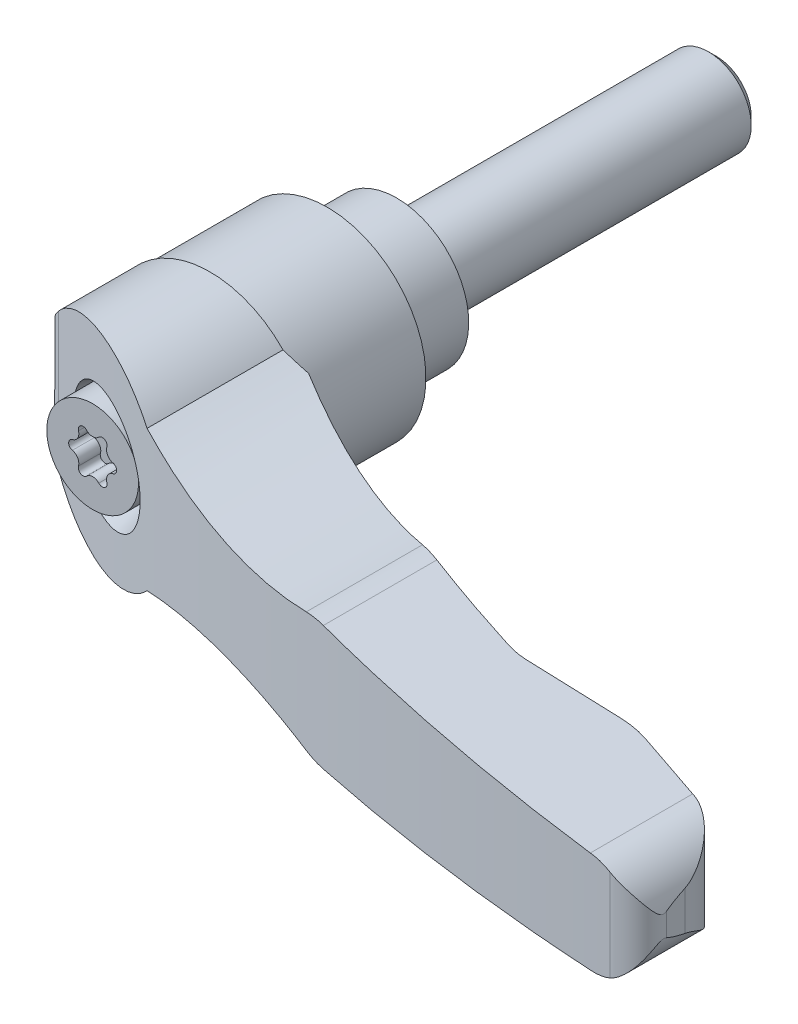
ISO-10303-21;
HEADER;
FILE_DESCRIPTION(('STEP AP214'),'2;1');
FILE_NAME('part.step','',(''),(''),'','','');
FILE_SCHEMA(('AUTOMOTIVE_DESIGN { 1 0 10303 214 1 1 1 1 }'));
ENDSEC;
DATA;
#1=APPLICATION_CONTEXT('core data for automotive mechanical design processes');
#2=APPLICATION_PROTOCOL_DEFINITION('international standard','automotive_design',2000,#1);
#3=PRODUCT_CONTEXT('',#1,'mechanical');
#4=PRODUCT('Part','Part','',(#3));
#5=PRODUCT_RELATED_PRODUCT_CATEGORY('part','',(#4));
#6=PRODUCT_DEFINITION_FORMATION('','',#4);
#7=PRODUCT_DEFINITION_CONTEXT('part definition',#1,'design');
#8=PRODUCT_DEFINITION('design','',#6,#7);
#9=PRODUCT_DEFINITION_SHAPE('','',#8);
#10=(LENGTH_UNIT() NAMED_UNIT(*) SI_UNIT(.MILLI.,.METRE.));
#11=(NAMED_UNIT(*) PLANE_ANGLE_UNIT() SI_UNIT($,.RADIAN.));
#12=(NAMED_UNIT(*) SI_UNIT($,.STERADIAN.) SOLID_ANGLE_UNIT());
#13=UNCERTAINTY_MEASURE_WITH_UNIT(LENGTH_MEASURE(1.E-05),#10,'distance_accuracy_value','');
#14=(GEOMETRIC_REPRESENTATION_CONTEXT(3) GLOBAL_UNCERTAINTY_ASSIGNED_CONTEXT((#13)) GLOBAL_UNIT_ASSIGNED_CONTEXT((#10,
#11,#12)) REPRESENTATION_CONTEXT('',''));
#15=CARTESIAN_POINT('',(0.,0.,0.));
#16=DIRECTION('',(0.,0.,1.));
#17=DIRECTION('',(1.,0.,0.));
#18=AXIS2_PLACEMENT_3D('',#15,#16,#17);
#19=CARTESIAN_POINT('',(0.,0.,-7.116040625));
#20=DIRECTION('',(0.,0.,-1.));
#21=DIRECTION('',(0.,1.,0.));
#22=AXIS2_PLACEMENT_3D('',#19,#20,#21);
#23=CYLINDRICAL_SURFACE('',#22,4.);
#24=CARTESIAN_POINT('',(0.,0.,-29.23));
#25=DIRECTION('',(0.,0.,-1.));
#26=DIRECTION('',(0.,1.,0.));
#27=AXIS2_PLACEMENT_3D('',#24,#25,#26);
#28=CIRCLE('',#27,4.);
#29=CARTESIAN_POINT('',(0.,4.,-29.23));
#30=VERTEX_POINT('',#29);
#31=EDGE_CURVE('E9',#30,#30,#28,.F.);
#32=ORIENTED_EDGE('',*,*,#31,.T.);
#33=EDGE_LOOP('',(#32));
#34=FACE_BOUND('',#33,.T.);
#35=CARTESIAN_POINT('',(0.,0.,0.));
#36=DIRECTION('',(0.,0.,-1.));
#37=DIRECTION('',(0.,1.,0.));
#38=AXIS2_PLACEMENT_3D('',#35,#36,#37);
#39=CIRCLE('',#38,4.);
#40=CARTESIAN_POINT('',(0.,4.,0.));
#41=VERTEX_POINT('',#40);
#42=EDGE_CURVE('E547',#41,#41,#39,.F.);
#43=ORIENTED_EDGE('',*,*,#42,.F.);
#44=EDGE_LOOP('',(#43));
#45=FACE_BOUND('',#44,.T.);
#46=ADVANCED_FACE('F14',(#34,#45),#23,.T.);
#47=CARTESIAN_POINT('',(5.375,0.,0.));
#48=DIRECTION('',(0.,0.,-1.));
#49=DIRECTION('',(0.,1.,0.));
#50=AXIS2_PLACEMENT_3D('',#47,#48,#49);
#51=PLANE('',#50);
#52=ORIENTED_EDGE('',*,*,#42,.T.);
#53=EDGE_LOOP('',(#52));
#54=FACE_BOUND('',#53,.T.);
#55=CARTESIAN_POINT('',(0.,0.,0.));
#56=DIRECTION('',(0.,0.,-1.));
#57=DIRECTION('',(0.,1.,0.));
#58=AXIS2_PLACEMENT_3D('',#55,#56,#57);
#59=CIRCLE('',#58,6.75);
#60=CARTESIAN_POINT('',(0.,6.75,0.));
#61=VERTEX_POINT('',#60);
#62=EDGE_CURVE('E732',#61,#61,#59,.F.);
#63=ORIENTED_EDGE('',*,*,#62,.F.);
#64=EDGE_LOOP('',(#63));
#65=FACE_BOUND('',#64,.T.);
#66=ADVANCED_FACE('F817',(#54,#65),#51,.T.);
#67=CARTESIAN_POINT('',(0.,0.,8.25));
#68=DIRECTION('',(0.,0.,-1.));
#69=DIRECTION('',(0.,1.,0.));
#70=AXIS2_PLACEMENT_3D('',#67,#68,#69);
#71=CYLINDRICAL_SURFACE('',#70,6.75);
#72=ORIENTED_EDGE('',*,*,#62,.T.);
#73=EDGE_LOOP('',(#72));
#74=FACE_BOUND('',#73,.T.);
#75=CARTESIAN_POINT('',(0.,0.,7.15000000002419));
#76=DIRECTION('',(0.,0.,-1.));
#77=DIRECTION('',(1.,0.,0.));
#78=AXIS2_PLACEMENT_3D('',#75,#76,#77);
#79=CIRCLE('',#78,6.74999999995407);
#80=CARTESIAN_POINT('',(6.74999999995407,0.,7.15000000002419));
#81=VERTEX_POINT('',#80);
#82=EDGE_CURVE('E540',#81,#81,#79,.T.);
#83=ORIENTED_EDGE('',*,*,#82,.T.);
#84=EDGE_LOOP('',(#83));
#85=FACE_BOUND('',#84,.T.);
#86=ADVANCED_FACE('F824',(#74,#85),#71,.T.);
#87=CARTESIAN_POINT('',(0.,0.,6.9000000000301));
#88=DIRECTION('',(0.,0.,-1.));
#89=DIRECTION('',(0.,1.,0.));
#90=AXIS2_PLACEMENT_3D('',#87,#88,#89);
#91=CONICAL_SURFACE('',#90,7.000000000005,0.785398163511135);
#92=ORIENTED_EDGE('',*,*,#82,.F.);
#93=EDGE_LOOP('',(#92));
#94=FACE_BOUND('',#93,.T.);
#95=CARTESIAN_POINT('',(0.,0.,6.9));
#96=DIRECTION('',(0.,0.,-1.));
#97=DIRECTION('',(0.,1.,0.));
#98=AXIS2_PLACEMENT_3D('',#95,#96,#97);
#99=CIRCLE('',#98,7.);
#100=CARTESIAN_POINT('',(0.,7.,6.9));
#101=VERTEX_POINT('',#100);
#102=EDGE_CURVE('E536',#101,#101,#99,.T.);
#103=ORIENTED_EDGE('',*,*,#102,.T.);
#104=EDGE_LOOP('',(#103));
#105=FACE_BOUND('',#104,.T.);
#106=ADVANCED_FACE('F832',(#94,#105),#91,.F.);
#107=CARTESIAN_POINT('',(0.,0.,6.2));
#108=DIRECTION('',(0.,0.,-1.));
#109=DIRECTION('',(0.,1.,0.));
#110=AXIS2_PLACEMENT_3D('',#107,#108,#109);
#111=CYLINDRICAL_SURFACE('',#110,7.);
#112=ORIENTED_EDGE('',*,*,#102,.F.);
#113=EDGE_LOOP('',(#112));
#114=FACE_BOUND('',#113,.T.);
#115=CARTESIAN_POINT('',(0.,0.,6.5));
#116=DIRECTION('',(0.,0.,-1.));
#117=DIRECTION('',(0.,1.,0.));
#118=AXIS2_PLACEMENT_3D('',#115,#116,#117);
#119=CIRCLE('',#118,7.);
#120=CARTESIAN_POINT('',(0.,7.,6.5));
#121=VERTEX_POINT('',#120);
#122=EDGE_CURVE('E539',#121,#121,#119,.F.);
#123=ORIENTED_EDGE('',*,*,#122,.F.);
#124=EDGE_LOOP('',(#123));
#125=FACE_BOUND('',#124,.T.);
#126=ADVANCED_FACE('F839',(#114,#125),#111,.F.);
#127=CARTESIAN_POINT('',(-9.01003775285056,-19.,6.5));
#128=DIRECTION('',(0.707106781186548,0.,0.707106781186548));
#129=DIRECTION('',(-0.707106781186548,0.,0.707106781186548));
#130=AXIS2_PLACEMENT_3D('',#127,#128,#129);
#131=PLANE('',#130);
#132=DIRECTION('',(0.,1.,0.));
#133=VECTOR('',#132,1.);
#134=CARTESIAN_POINT('',(-9.01003775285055,0.,6.5));
#135=LINE('',#134,#133);
#136=CARTESIAN_POINT('',(-9.01003775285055,-2.13584185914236,6.5));
#137=VERTEX_POINT('',#136);
#138=CARTESIAN_POINT('',(-9.01003775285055,2.13584185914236,6.5));
#139=VERTEX_POINT('',#138);
#140=EDGE_CURVE('E727',#137,#139,#135,.T.);
#141=ORIENTED_EDGE('',*,*,#140,.F.);
#142=CARTESIAN_POINT('',(-0.00999999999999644,0.,-2.50003775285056));
#143=DIRECTION('',(0.707106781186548,0.,0.707106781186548));
#144=DIRECTION('',(-0.707106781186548,0.,0.707106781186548));
#145=AXIS2_PLACEMENT_3D('',#142,#143,#144);
#146=ELLIPSE('',#145,13.0814754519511,9.25);
#147=EDGE_CURVE('E724',#139,#137,#146,.T.);
#148=ORIENTED_EDGE('',*,*,#147,.F.);
#149=EDGE_LOOP('',(#141,#148));
#150=FACE_BOUND('',#149,.T.);
#151=ADVANCED_FACE('F843',(#150),#131,.F.);
#152=CARTESIAN_POINT('',(-4.635,0.,6.5));
#153=DIRECTION('',(0.,0.,-1.));
#154=DIRECTION('',(0.,1.,0.));
#155=AXIS2_PLACEMENT_3D('',#152,#153,#154);
#156=PLANE('',#155);
#157=ORIENTED_EDGE('',*,*,#140,.T.);
#158=CARTESIAN_POINT('',(-0.00999999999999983,0.,6.5));
#159=DIRECTION('',(0.,0.,1.));
#160=DIRECTION('',(-1.,0.,0.));
#161=AXIS2_PLACEMENT_3D('',#158,#159,#160);
#162=CIRCLE('',#161,9.25);
#163=EDGE_CURVE('E720',#137,#139,#162,.T.);
#164=ORIENTED_EDGE('',*,*,#163,.F.);
#165=EDGE_LOOP('',(#157,#164));
#166=FACE_BOUND('',#165,.T.);
#167=ORIENTED_EDGE('',*,*,#122,.T.);
#168=EDGE_LOOP('',(#167));
#169=FACE_BOUND('',#168,.T.);
#170=ADVANCED_FACE('F847',(#166,#169),#156,.T.);
#171=CARTESIAN_POINT('',(-0.0100000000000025,0.,13.5625));
#172=DIRECTION('',(0.,0.,1.));
#173=DIRECTION('',(-1.,0.,0.));
#174=AXIS2_PLACEMENT_3D('',#171,#172,#173);
#175=CYLINDRICAL_SURFACE('',#174,9.25);
#176=ORIENTED_EDGE('',*,*,#163,.T.);
#177=ORIENTED_EDGE('',*,*,#147,.T.);
#178=EDGE_LOOP('',(#176,#177));
#179=FACE_BOUND('',#178,.T.);
#180=CARTESIAN_POINT('',(-0.010000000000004,0.,17.5));
#181=DIRECTION('',(0.,0.,1.));
#182=DIRECTION('',(-1.,0.,0.));
#183=AXIS2_PLACEMENT_3D('',#180,#181,#182);
#184=CIRCLE('',#183,9.25);
#185=CARTESIAN_POINT('',(-9.26,0.,17.5));
#186=VERTEX_POINT('',#185);
#187=CARTESIAN_POINT('',(9.23999999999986,0.,17.5000000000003));
#188=VERTEX_POINT('',#187);
#189=EDGE_CURVE('E710',#186,#188,#184,.T.);
#190=ORIENTED_EDGE('',*,*,#189,.F.);
#191=CARTESIAN_POINT('',(-0.010000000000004,0.,17.5));
#192=DIRECTION('',(0.,0.,1.));
#193=DIRECTION('',(-1.,0.,0.));
#194=AXIS2_PLACEMENT_3D('',#191,#192,#193);
#195=CIRCLE('',#194,9.25);
#196=EDGE_CURVE('E531',#188,#186,#195,.T.);
#197=ORIENTED_EDGE('',*,*,#196,.F.);
#198=EDGE_LOOP('',(#190,#197));
#199=FACE_BOUND('',#198,.T.);
#200=ADVANCED_FACE('F717',(#179,#199),#175,.T.);
#201=CARTESIAN_POINT('',(64.6274051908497,-10.5,37.5817950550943));
#202=DIRECTION('',(0.992331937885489,0.,-0.123601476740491));
#203=DIRECTION('',(0.123601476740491,0.,0.992331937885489));
#204=AXIS2_PLACEMENT_3D('',#201,#202,#203);
#205=PLANE('',#204);
#206=CARTESIAN_POINT('',(60.25,0.,2.43788666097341));
#207=DIRECTION('',(0.992331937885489,0.,-0.123601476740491));
#208=DIRECTION('',(0.123601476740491,0.,0.992331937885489));
#209=AXIS2_PLACEMENT_3D('',#206,#207,#208);
#210=ELLIPSE('',#209,38.4299615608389,4.75);
#211=CARTESIAN_POINT('',(64.8745408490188,1.08449155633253,39.5659186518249));
#212=VERTEX_POINT('',#211);
#213=CARTESIAN_POINT('',(64.6274051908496,1.84413226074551,37.5817950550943));
#214=VERTEX_POINT('',#213);
#215=EDGE_CURVE('E421',#212,#214,#210,.F.);
#216=ORIENTED_EDGE('',*,*,#215,.F.);
#217=DIRECTION('',(0.,-1.,0.));
#218=VECTOR('',#217,1.);
#219=CARTESIAN_POINT('',(64.8745408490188,-10.5,39.5659186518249));
#220=LINE('',#219,#218);
#221=CARTESIAN_POINT('',(64.8745408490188,-1.08449155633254,39.5659186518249));
#222=VERTEX_POINT('',#221);
#223=EDGE_CURVE('E460',#222,#212,#220,.F.);
#224=ORIENTED_EDGE('',*,*,#223,.F.);
#225=CARTESIAN_POINT('',(60.25,0.,2.43788666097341));
#226=DIRECTION('',(0.992331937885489,0.,-0.123601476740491));
#227=DIRECTION('',(0.123601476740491,0.,0.992331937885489));
#228=AXIS2_PLACEMENT_3D('',#225,#226,#227);
#229=ELLIPSE('',#228,38.4299615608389,4.75);
#230=CARTESIAN_POINT('',(64.6274051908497,-1.84413226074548,37.5817950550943));
#231=VERTEX_POINT('',#230);
#232=EDGE_CURVE('E444',#231,#222,#229,.F.);
#233=ORIENTED_EDGE('',*,*,#232,.F.);
#234=DIRECTION('',(0.,-1.,0.));
#235=VECTOR('',#234,1.);
#236=CARTESIAN_POINT('',(64.6274051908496,-10.5,37.5817950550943));
#237=LINE('',#236,#235);
#238=EDGE_CURVE('E718',#214,#231,#237,.T.);
#239=ORIENTED_EDGE('',*,*,#238,.F.);
#240=EDGE_LOOP('',(#216,#224,#233,#239));
#241=FACE_BOUND('',#240,.T.);
#242=ADVANCED_FACE('F430',(#241),#205,.T.);
#243=CARTESIAN_POINT('',(58.6337202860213,-10.5,38.3283479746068));
#244=DIRECTION('',(0.,-1.,0.));
#245=DIRECTION('',(1.,0.,0.));
#246=AXIS2_PLACEMENT_3D('',#243,#244,#245);
#247=CYLINDRICAL_SURFACE('',#246,6.04);
#248=CARTESIAN_POINT('',(64.6274051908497,1.84413226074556,37.5817950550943));
#249=CARTESIAN_POINT('',(64.6175868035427,1.86745330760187,37.5030045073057));
#250=CARTESIAN_POINT('',(64.6063375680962,1.89362327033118,37.4253204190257));
#251=CARTESIAN_POINT('',(64.5811702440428,1.95049016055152,37.2721928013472));
#252=CARTESIAN_POINT('',(64.5672561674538,1.98118026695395,37.1967460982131));
#253=CARTESIAN_POINT('',(64.5369883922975,2.04585034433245,37.0482136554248));
#254=CARTESIAN_POINT('',(64.520645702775,2.07981523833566,36.9751189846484));
#255=CARTESIAN_POINT('',(64.4855821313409,2.15032519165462,36.8307396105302));
#256=CARTESIAN_POINT('',(64.4668602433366,2.18687133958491,36.7594556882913));
#257=CARTESIAN_POINT('',(64.4072221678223,2.29938724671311,36.547961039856));
#258=CARTESIAN_POINT('',(64.3628565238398,2.37818379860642,36.410218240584));
#259=CARTESIAN_POINT('',(64.2652007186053,2.53960895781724,36.1400450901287));
#260=CARTESIAN_POINT('',(64.2118976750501,2.6222429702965,36.007622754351));
#261=CARTESIAN_POINT('',(64.077119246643,2.81672317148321,35.7040219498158));
#262=CARTESIAN_POINT('',(63.9921849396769,2.92909268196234,35.5347005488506));
#263=CARTESIAN_POINT('',(63.8063278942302,3.15216626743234,35.2039790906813));
#264=CARTESIAN_POINT('',(63.7054078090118,3.26287061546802,35.0425777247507));
#265=CARTESIAN_POINT('',(63.4870671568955,3.47959027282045,34.7278934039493));
#266=CARTESIAN_POINT('',(63.369645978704,3.58560540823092,34.5746107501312));
#267=CARTESIAN_POINT('',(63.1179209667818,3.78996521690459,34.277236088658));
#268=CARTESIAN_POINT('',(62.9836257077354,3.88831374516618,34.1331394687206));
#269=CARTESIAN_POINT('',(62.6561598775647,4.10136712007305,33.815313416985));
#270=CARTESIAN_POINT('',(62.4571888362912,4.21258905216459,33.6450495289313));
#271=CARTESIAN_POINT('',(62.1378586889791,4.36029911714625,33.4069452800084));
#272=CARTESIAN_POINT('',(62.0281124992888,4.40629516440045,33.3305585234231));
#273=CARTESIAN_POINT('',(61.8018114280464,4.49098569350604,33.1841350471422));
#274=CARTESIAN_POINT('',(61.6852609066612,4.52968478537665,33.1140943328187));
#275=CARTESIAN_POINT('',(61.4786111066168,4.58924867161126,32.9993621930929));
#276=CARTESIAN_POINT('',(61.3900115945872,4.61209493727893,32.9529824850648));
#277=CARTESIAN_POINT('',(61.2097340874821,4.65295056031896,32.8642982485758));
#278=CARTESIAN_POINT('',(61.1180570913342,4.67096147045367,32.82199241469));
#279=CARTESIAN_POINT('',(60.9313596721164,4.70183469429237,32.7415027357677));
#280=CARTESIAN_POINT('',(60.8363219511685,4.71466416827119,32.7033462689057));
#281=CARTESIAN_POINT('',(60.6438287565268,4.73463763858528,32.631712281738));
#282=CARTESIAN_POINT('',(60.5463713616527,4.74177695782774,32.5982386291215));
#283=CARTESIAN_POINT('',(60.4479724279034,4.74587261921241,32.5672639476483));
#284=B_SPLINE_CURVE_WITH_KNOTS('',3,(#248,#249,#250,#251,#252,#253,#254,#255,#256,#257,#258,
#259,#260,#261,#262,#263,#264,#265,#266,#267,#268,#269,#270,#271,#272,#273,#274,#275,#276,#277,
#278,#279,#280,#281,#282,#283),.UNSPECIFIED.,.F.,.F.,(4,2,2,2,2,2,2,2,2,2,2,2,2,2,2,2,2,4),(0.,
0.248076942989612,0.495783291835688,0.742399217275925,0.989119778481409,1.48293160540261,
1.97746142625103,2.63745339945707,3.29733594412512,3.95724294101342,4.61681594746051,
5.46693586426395,5.89075482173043,6.31430511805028,6.62183365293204,6.92926331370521,
7.23861197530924,7.54821464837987),.UNSPECIFIED.);
#285=CARTESIAN_POINT('',(60.4479724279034,4.74587261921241,32.5672639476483));
#286=VERTEX_POINT('',#285);
#287=EDGE_CURVE('E412',#214,#286,#284,.T.);
#288=ORIENTED_EDGE('',*,*,#287,.F.);
#289=ORIENTED_EDGE('',*,*,#238,.T.);
#290=CARTESIAN_POINT('',(60.4479724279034,-4.74587261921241,32.5672639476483));
#291=CARTESIAN_POINT('',(60.5755504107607,-4.74057354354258,32.6074069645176));
#292=CARTESIAN_POINT('',(60.7015088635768,-4.73014540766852,32.6517620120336));
#293=CARTESIAN_POINT('',(60.9490652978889,-4.69992242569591,32.7481786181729));
#294=CARTESIAN_POINT('',(61.0706698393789,-4.6801423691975,32.8002279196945));
#295=CARTESIAN_POINT('',(61.3074659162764,-4.63235500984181,32.9108206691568));
#296=CARTESIAN_POINT('',(61.4227141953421,-4.60444273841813,32.9692844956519));
#297=CARTESIAN_POINT('',(61.6477173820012,-4.54120548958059,33.0925213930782));
#298=CARTESIAN_POINT('',(61.7574696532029,-4.50587699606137,33.1572974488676));
#299=CARTESIAN_POINT('',(61.9940137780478,-4.42040174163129,33.307032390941));
#300=CARTESIAN_POINT('',(62.1193938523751,-4.36870213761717,33.3933358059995));
#301=CARTESIAN_POINT('',(62.3610721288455,-4.25718277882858,33.5732278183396));
#302=CARTESIAN_POINT('',(62.4773638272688,-4.19735729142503,33.6668215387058));
#303=CARTESIAN_POINT('',(62.7012840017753,-4.07066877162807,33.8608437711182));
#304=CARTESIAN_POINT('',(62.8088611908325,-4.0037687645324,33.9613071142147));
#305=CARTESIAN_POINT('',(63.0146476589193,-3.86453813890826,34.1677809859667));
#306=CARTESIAN_POINT('',(63.1128596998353,-3.79220913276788,34.2737898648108));
#307=CARTESIAN_POINT('',(63.3331746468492,-3.61700510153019,34.5290929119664));
#308=CARTESIAN_POINT('',(63.4514763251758,-3.51235864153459,34.6804594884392));
#309=CARTESIAN_POINT('',(63.6718053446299,-3.29808480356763,34.9913387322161));
#310=CARTESIAN_POINT('',(63.7738256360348,-3.18845529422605,35.1508548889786));
#311=CARTESIAN_POINT('',(63.961662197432,-2.9676568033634,35.4770445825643));
#312=CARTESIAN_POINT('',(64.0475378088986,-2.85649513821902,35.6436890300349));
#313=CARTESIAN_POINT('',(64.2038484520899,-2.63586419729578,35.9851508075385));
#314=CARTESIAN_POINT('',(64.2742871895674,-2.52639452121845,36.1599661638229));
#315=CARTESIAN_POINT('',(64.3705847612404,-2.36382517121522,36.4361542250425));
#316=CARTESIAN_POINT('',(64.4019853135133,-2.30809068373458,36.5340606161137));
#317=CARTESIAN_POINT('',(64.4601539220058,-2.20019362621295,36.7330390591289));
#318=CARTESIAN_POINT('',(64.4869269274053,-2.14802727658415,36.8341075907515));
#319=CARTESIAN_POINT('',(64.5357331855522,-2.04890785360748,37.0402846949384));
#320=CARTESIAN_POINT('',(64.5577546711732,-2.00196785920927,37.1454025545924));
#321=CARTESIAN_POINT('',(64.596614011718,-1.91618262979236,37.360168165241));
#322=CARTESIAN_POINT('',(64.6134353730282,-1.87736327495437,37.4698291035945));
#323=CARTESIAN_POINT('',(64.6274051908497,-1.84413226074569,37.5817950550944));
#324=B_SPLINE_CURVE_WITH_KNOTS('',3,(#290,#291,#292,#293,#294,#295,#296,#297,#298,#299,#300,
#301,#302,#303,#304,#305,#306,#307,#308,#309,#310,#311,#312,#313,#314,#315,#316,#317,#318,#319,
#320,#321,#322,#323),.UNSPECIFIED.,.F.,.F.,(4,2,2,2,2,2,2,2,2,2,2,2,2,2,2,2,4),(0.,
0.401264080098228,0.801895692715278,1.19802151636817,1.59433557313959,2.0758833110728,
2.55777255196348,3.04231807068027,3.52672024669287,4.18208013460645,4.83772302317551,
5.49090678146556,6.1439335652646,6.49464389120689,6.84497677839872,7.19616755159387,
7.54846105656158),.UNSPECIFIED.);
#325=CARTESIAN_POINT('',(60.4479724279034,-4.74587261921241,32.5672639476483));
#326=VERTEX_POINT('',#325);
#327=EDGE_CURVE('E436',#326,#231,#324,.T.);
#328=ORIENTED_EDGE('',*,*,#327,.F.);
#329=DIRECTION('',(0.,-1.,0.));
#330=VECTOR('',#329,1.);
#331=CARTESIAN_POINT('',(60.4479724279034,-10.5,32.5672639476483));
#332=LINE('',#331,#330);
#333=EDGE_CURVE('E526',#286,#326,#332,.T.);
#334=ORIENTED_EDGE('',*,*,#333,.F.);
#335=EDGE_LOOP('',(#288,#289,#328,#334));
#336=FACE_BOUND('',#335,.T.);
#337=ADVANCED_FACE('F424',(#336),#247,.T.);
#338=CARTESIAN_POINT('',(-9.26,-10.5,17.5));
#339=DIRECTION('',(0.,0.,-1.));
#340=DIRECTION('',(0.,1.,0.));
#341=AXIS2_PLACEMENT_3D('',#338,#339,#340);
#342=PLANE('',#341);
#343=DIRECTION('',(0.,-1.,0.));
#344=VECTOR('',#343,1.);
#345=CARTESIAN_POINT('',(-9.26,-10.5,17.5));
#346=LINE('',#345,#344);
#347=CARTESIAN_POINT('',(-9.26,2.12188595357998,17.5));
#348=VERTEX_POINT('',#347);
#349=EDGE_CURVE('E527',#348,#186,#346,.T.);
#350=ORIENTED_EDGE('',*,*,#349,.F.);
#351=CARTESIAN_POINT('',(0.,0.,17.5));
#352=DIRECTION('',(0.,0.,1.));
#353=DIRECTION('',(0.,-1.,0.));
#354=AXIS2_PLACEMENT_3D('',#351,#352,#353);
#355=CIRCLE('',#354,9.5);
#356=CARTESIAN_POINT('',(6.84374087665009,6.58887022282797,17.5));
#357=VERTEX_POINT('',#356);
#358=EDGE_CURVE('E338',#357,#348,#355,.T.);
#359=ORIENTED_EDGE('',*,*,#358,.F.);
#360=CARTESIAN_POINT('',(19.25,44.09,17.5));
#361=DIRECTION('',(0.,0.,1.));
#362=DIRECTION('',(0.,-1.,0.));
#363=AXIS2_PLACEMENT_3D('',#360,#361,#362);
#364=CIRCLE('',#363,39.5);
#365=CARTESIAN_POINT('',(9.23999999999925,5.87940068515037,17.5000000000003));
#366=VERTEX_POINT('',#365);
#367=EDGE_CURVE('E339',#357,#366,#364,.T.);
#368=ORIENTED_EDGE('',*,*,#367,.T.);
#369=DIRECTION('',(0.,-1.,0.));
#370=VECTOR('',#369,1.);
#371=CARTESIAN_POINT('',(9.23999999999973,-10.5,17.5000000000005));
#372=LINE('',#371,#370);
#373=EDGE_CURVE('E471',#366,#188,#372,.T.);
#374=ORIENTED_EDGE('',*,*,#373,.T.);
#375=ORIENTED_EDGE('',*,*,#196,.T.);
#376=EDGE_LOOP('',(#350,#359,#368,#374,#375));
#377=FACE_BOUND('',#376,.T.);
#378=ADVANCED_FACE('F429',(#377),#342,.T.);
#379=CARTESIAN_POINT('',(-9.26,-10.5,21.2038249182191));
#380=DIRECTION('',(-1.,0.,0.));
#381=DIRECTION('',(0.,-1.,0.));
#382=AXIS2_PLACEMENT_3D('',#379,#380,#381);
#383=PLANE('',#382);
#384=ORIENTED_EDGE('',*,*,#349,.T.);
#385=DIRECTION('',(0.,1.,0.));
#386=VECTOR('',#385,1.);
#387=CARTESIAN_POINT('',(-9.26,-10.5,17.5));
#388=LINE('',#387,#386);
#389=CARTESIAN_POINT('',(-9.26,-2.12188595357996,17.5));
#390=VERTEX_POINT('',#389);
#391=EDGE_CURVE('E706',#390,#186,#388,.T.);
#392=ORIENTED_EDGE('',*,*,#391,.F.);
#393=DIRECTION('',(0.,0.,1.));
#394=VECTOR('',#393,1.);
#395=CARTESIAN_POINT('',(-9.26,-2.12188595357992,42.5));
#396=LINE('',#395,#394);
#397=CARTESIAN_POINT('',(-9.26,-2.12188595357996,21.2038249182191));
#398=VERTEX_POINT('',#397);
#399=EDGE_CURVE('E530',#398,#390,#396,.F.);
#400=ORIENTED_EDGE('',*,*,#399,.F.);
#401=DIRECTION('',(0.,-1.,0.));
#402=VECTOR('',#401,1.);
#403=CARTESIAN_POINT('',(-9.26,-10.5,21.2038249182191));
#404=LINE('',#403,#402);
#405=CARTESIAN_POINT('',(-9.26,2.12188595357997,21.2038249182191));
#406=VERTEX_POINT('',#405);
#407=EDGE_CURVE('E493',#406,#398,#404,.T.);
#408=ORIENTED_EDGE('',*,*,#407,.F.);
#409=DIRECTION('',(0.,0.,1.));
#410=VECTOR('',#409,1.);
#411=CARTESIAN_POINT('',(-9.26,2.12188595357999,42.5));
#412=LINE('',#411,#410);
#413=EDGE_CURVE('E491',#348,#406,#412,.T.);
#414=ORIENTED_EDGE('',*,*,#413,.F.);
#415=EDGE_LOOP('',(#384,#392,#400,#408,#414));
#416=FACE_BOUND('',#415,.T.);
#417=ADVANCED_FACE('F708',(#416),#383,.T.);
#418=CARTESIAN_POINT('',(-9.26,-10.5,17.5));
#419=DIRECTION('',(0.,0.,-1.));
#420=DIRECTION('',(0.,1.,0.));
#421=AXIS2_PLACEMENT_3D('',#418,#419,#420);
#422=PLANE('',#421);
#423=DIRECTION('',(0.,-1.,0.));
#424=VECTOR('',#423,1.);
#425=CARTESIAN_POINT('',(9.23999999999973,-10.5,17.5000000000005));
#426=LINE('',#425,#424);
#427=CARTESIAN_POINT('',(9.23999999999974,-5.87940068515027,17.5000000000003));
#428=VERTEX_POINT('',#427);
#429=EDGE_CURVE('E639',#188,#428,#426,.T.);
#430=ORIENTED_EDGE('',*,*,#429,.T.);
#431=CARTESIAN_POINT('',(19.25,-44.09,17.5));
#432=DIRECTION('',(0.,0.,1.));
#433=DIRECTION('',(0.,-1.,0.));
#434=AXIS2_PLACEMENT_3D('',#431,#432,#433);
#435=CIRCLE('',#434,39.5);
#436=CARTESIAN_POINT('',(6.84374087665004,-6.588870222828,17.5));
#437=VERTEX_POINT('',#436);
#438=EDGE_CURVE('E305',#428,#437,#435,.T.);
#439=ORIENTED_EDGE('',*,*,#438,.T.);
#440=CARTESIAN_POINT('',(0.,0.,17.5));
#441=DIRECTION('',(0.,0.,1.));
#442=DIRECTION('',(0.,-1.,0.));
#443=AXIS2_PLACEMENT_3D('',#440,#441,#442);
#444=CIRCLE('',#443,9.5);
#445=EDGE_CURVE('E496',#390,#437,#444,.T.);
#446=ORIENTED_EDGE('',*,*,#445,.F.);
#447=ORIENTED_EDGE('',*,*,#391,.T.);
#448=ORIENTED_EDGE('',*,*,#189,.T.);
#449=EDGE_LOOP('',(#430,#439,#446,#447,#448));
#450=FACE_BOUND('',#449,.T.);
#451=ADVANCED_FACE('F701',(#450),#422,.T.);
#452=CARTESIAN_POINT('',(53.8294507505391,-10.5,30.4829917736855));
#453=DIRECTION('',(0.300372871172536,0.,-0.95382185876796));
#454=DIRECTION('',(0.95382185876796,0.,0.300372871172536));
#455=AXIS2_PLACEMENT_3D('',#452,#453,#454);
#456=PLANE('',#455);
#457=CARTESIAN_POINT('',(60.25,0.,32.5049194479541));
#458=DIRECTION('',(0.300372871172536,0.,-0.95382185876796));
#459=DIRECTION('',(0.95382185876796,0.,0.300372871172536));
#460=AXIS2_PLACEMENT_3D('',#457,#458,#459);
#461=ELLIPSE('',#460,4.97996555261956,4.75);
#462=CARTESIAN_POINT('',(60.25,4.75,32.5049194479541));
#463=VERTEX_POINT('',#462);
#464=EDGE_CURVE('E461',#286,#463,#461,.F.);
#465=ORIENTED_EDGE('',*,*,#464,.F.);
#466=ORIENTED_EDGE('',*,*,#333,.T.);
#467=CARTESIAN_POINT('',(60.25,0.,32.5049194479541));
#468=DIRECTION('',(0.300372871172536,0.,-0.95382185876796));
#469=DIRECTION('',(0.95382185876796,0.,0.300372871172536));
#470=AXIS2_PLACEMENT_3D('',#467,#468,#469);
#471=ELLIPSE('',#470,4.97996555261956,4.75);
#472=CARTESIAN_POINT('',(60.25,-4.75,32.5049194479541));
#473=VERTEX_POINT('',#472);
#474=EDGE_CURVE('E445',#473,#326,#471,.F.);
#475=ORIENTED_EDGE('',*,*,#474,.F.);
#476=DIRECTION('',(-0.953255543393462,-0.0344545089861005,-0.300194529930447));
#477=VECTOR('',#476,1.);
#478=CARTESIAN_POINT('',(60.25,-4.75,32.5049194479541));
#479=LINE('',#478,#477);
#480=CARTESIAN_POINT('',(53.8294507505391,-4.98206460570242,30.4829917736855));
#481=VERTEX_POINT('',#480);
#482=EDGE_CURVE('E508',#473,#481,#479,.T.);
#483=ORIENTED_EDGE('',*,*,#482,.T.);
#484=DIRECTION('',(0.,-1.,0.));
#485=VECTOR('',#484,1.);
#486=CARTESIAN_POINT('',(53.8294507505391,-10.5,30.4829917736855));
#487=LINE('',#486,#485);
#488=CARTESIAN_POINT('',(53.8294507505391,4.98206460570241,30.4829917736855));
#489=VERTEX_POINT('',#488);
#490=EDGE_CURVE('E523',#489,#481,#487,.T.);
#491=ORIENTED_EDGE('',*,*,#490,.F.);
#492=DIRECTION('',(0.953255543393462,-0.0344545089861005,0.300194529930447));
#493=VECTOR('',#492,1.);
#494=CARTESIAN_POINT('',(53.8294507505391,4.98206460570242,30.4829917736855));
#495=LINE('',#494,#493);
#496=EDGE_CURVE('E473',#489,#463,#495,.T.);
#497=ORIENTED_EDGE('',*,*,#496,.T.);
#498=EDGE_LOOP('',(#465,#466,#475,#483,#491,#497));
#499=FACE_BOUND('',#498,.T.);
#500=ADVANCED_FACE('F868',(#499),#456,.T.);
#501=CARTESIAN_POINT('',(51.0780352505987,-10.5,39.22));
#502=DIRECTION('',(0.,-1.,0.));
#503=DIRECTION('',(1.,0.,0.));
#504=AXIS2_PLACEMENT_3D('',#501,#502,#503);
#505=CYLINDRICAL_SURFACE('',#504,9.15999999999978);
#506=CARTESIAN_POINT('',(51.0780352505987,5.08151188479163,39.22));
#507=DIRECTION('',(-0.0361204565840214,-0.999347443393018,0.));
#508=DIRECTION('',(0.999347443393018,-0.0361204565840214,0.));
#509=AXIS2_PLACEMENT_3D('',#506,#507,#508);
#510=ELLIPSE('',#509,9.16598132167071,9.15999999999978);
#511=CARTESIAN_POINT('',(51.0780352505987,5.08151188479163,30.06));
#512=VERTEX_POINT('',#511);
#513=EDGE_CURVE('E476',#512,#489,#510,.T.);
#514=ORIENTED_EDGE('',*,*,#513,.T.);
#515=ORIENTED_EDGE('',*,*,#490,.T.);
#516=CARTESIAN_POINT('',(51.0780352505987,-5.08151188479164,39.22));
#517=DIRECTION('',(-0.0361204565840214,0.999347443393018,0.));
#518=DIRECTION('',(-0.999347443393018,-0.0361204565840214,0.));
#519=AXIS2_PLACEMENT_3D('',#516,#517,#518);
#520=ELLIPSE('',#519,9.16598132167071,9.15999999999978);
#521=CARTESIAN_POINT('',(51.0780352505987,-5.08151188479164,30.06));
#522=VERTEX_POINT('',#521);
#523=EDGE_CURVE('E303',#481,#522,#520,.T.);
#524=ORIENTED_EDGE('',*,*,#523,.T.);
#525=DIRECTION('',(0.,1.,0.));
#526=VECTOR('',#525,1.);
#527=CARTESIAN_POINT('',(51.0780352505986,-10.5,30.06));
#528=LINE('',#527,#526);
#529=EDGE_CURVE('E520',#512,#522,#528,.F.);
#530=ORIENTED_EDGE('',*,*,#529,.F.);
#531=EDGE_LOOP('',(#514,#515,#524,#530));
#532=FACE_BOUND('',#531,.T.);
#533=ADVANCED_FACE('F877',(#532),#505,.T.);
#534=CARTESIAN_POINT('',(42.239481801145,-10.5,30.06));
#535=DIRECTION('',(0.,0.,-1.));
#536=DIRECTION('',(0.,1.,0.));
#537=AXIS2_PLACEMENT_3D('',#534,#535,#536);
#538=PLANE('',#537);
#539=DIRECTION('',(0.999347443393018,-0.0361204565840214,0.));
#540=VECTOR('',#539,1.);
#541=CARTESIAN_POINT('',(30.3472861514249,5.83080496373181,30.06));
#542=LINE('',#541,#540);
#543=CARTESIAN_POINT('',(42.239481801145,5.4009729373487,30.06));
#544=VERTEX_POINT('',#543);
#545=EDGE_CURVE('E477',#544,#512,#542,.T.);
#546=ORIENTED_EDGE('',*,*,#545,.T.);
#547=ORIENTED_EDGE('',*,*,#529,.T.);
#548=DIRECTION('',(-0.999347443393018,-0.0361204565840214,0.));
#549=VECTOR('',#548,1.);
#550=CARTESIAN_POINT('',(60.25,-4.75,30.06));
#551=LINE('',#550,#549);
#552=CARTESIAN_POINT('',(42.239481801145,-5.4009729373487,30.06));
#553=VERTEX_POINT('',#552);
#554=EDGE_CURVE('E505',#522,#553,#551,.T.);
#555=ORIENTED_EDGE('',*,*,#554,.T.);
#556=DIRECTION('',(0.,-1.,0.));
#557=VECTOR('',#556,1.);
#558=CARTESIAN_POINT('',(42.239481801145,-10.5,30.06));
#559=LINE('',#558,#557);
#560=EDGE_CURVE('E518',#553,#544,#559,.F.);
#561=ORIENTED_EDGE('',*,*,#560,.T.);
#562=EDGE_LOOP('',(#546,#547,#555,#561));
#563=FACE_BOUND('',#562,.T.);
#564=ADVANCED_FACE('F880',(#563),#538,.T.);
#565=CARTESIAN_POINT('',(42.2394818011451,-10.5,23.0799999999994));
#566=DIRECTION('',(0.,-1.,0.));
#567=DIRECTION('',(1.,0.,0.));
#568=AXIS2_PLACEMENT_3D('',#565,#566,#567);
#569=CYLINDRICAL_SURFACE('',#568,6.98000000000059);
#570=DIRECTION('',(0.,-1.,0.));
#571=VECTOR('',#570,1.);
#572=CARTESIAN_POINT('',(40.3024609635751,-10.5,29.785844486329));
#573=LINE('',#572,#571);
#574=CARTESIAN_POINT('',(40.3024609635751,-5.47098470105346,29.7858444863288));
#575=VERTEX_POINT('',#574);
#576=CARTESIAN_POINT('',(40.3024609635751,5.47098470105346,29.7858444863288));
#577=VERTEX_POINT('',#576);
#578=EDGE_CURVE('E535',#575,#577,#573,.F.);
#579=ORIENTED_EDGE('',*,*,#578,.T.);
#580=CARTESIAN_POINT('',(42.2394818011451,5.40097293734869,23.0799999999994));
#581=DIRECTION('',(-0.0361204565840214,-0.999347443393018,0.));
#582=DIRECTION('',(0.999347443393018,-0.0361204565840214,0.));
#583=AXIS2_PLACEMENT_3D('',#580,#581,#582);
#584=ELLIPSE('',#583,6.98455781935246,6.98000000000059);
#585=EDGE_CURVE('E480',#577,#544,#584,.F.);
#586=ORIENTED_EDGE('',*,*,#585,.T.);
#587=ORIENTED_EDGE('',*,*,#560,.F.);
#588=CARTESIAN_POINT('',(42.2394818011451,-5.4009729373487,23.0799999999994));
#589=DIRECTION('',(-0.0361204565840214,0.999347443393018,0.));
#590=DIRECTION('',(-0.999347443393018,-0.0361204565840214,0.));
#591=AXIS2_PLACEMENT_3D('',#588,#589,#590);
#592=ELLIPSE('',#591,6.98455781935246,6.98000000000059);
#593=EDGE_CURVE('E507',#553,#575,#592,.F.);
#594=ORIENTED_EDGE('',*,*,#593,.T.);
#595=EDGE_LOOP('',(#579,#586,#587,#594));
#596=FACE_BOUND('',#595,.T.);
#597=ADVANCED_FACE('F313',(#596),#569,.F.);
#598=CARTESIAN_POINT('',(88.9416647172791,-10.5,-138.600024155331));
#599=DIRECTION('',(0.,-1.,0.));
#600=DIRECTION('',(1.,0.,0.));
#601=AXIS2_PLACEMENT_3D('',#598,#599,#600);
#602=CYLINDRICAL_SURFACE('',#601,175.27);
#603=CARTESIAN_POINT('',(30.3472861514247,5.83080496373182,26.5855433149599));
#604=CARTESIAN_POINT('',(30.1696679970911,5.83722947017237,26.5225405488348));
#605=CARTESIAN_POINT('',(29.9919650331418,5.83772087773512,26.45918181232));
#606=CARTESIAN_POINT('',(29.6377732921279,5.82691956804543,26.3322542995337));
#607=CARTESIAN_POINT('',(29.461282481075,5.81567269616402,26.2686872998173));
#608=CARTESIAN_POINT('',(29.1095062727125,5.78152581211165,26.1413510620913));
#609=CARTESIAN_POINT('',(28.9342208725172,5.75862582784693,26.0775818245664));
#610=CARTESIAN_POINT('',(28.5848474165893,5.70116062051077,25.9498538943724));
#611=CARTESIAN_POINT('',(28.4107667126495,5.6665501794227,25.8858954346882));
#612=CARTESIAN_POINT('',(28.2379732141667,5.62616845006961,25.8220994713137));
#613=B_SPLINE_CURVE_WITH_KNOTS('',3,(#603,#604,#605,#606,#607,#608,#609,#610,#611,#612),
.UNSPECIFIED.,.F.,.F.,(4,2,2,2,4),(0.,0.565613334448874,1.1290258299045,1.69243697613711,
2.2580489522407),.UNSPECIFIED.);
#614=CARTESIAN_POINT('',(30.3472861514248,5.83080496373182,26.5855433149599));
#615=VERTEX_POINT('',#614);
#616=CARTESIAN_POINT('',(28.2379732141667,5.62616845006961,25.8220994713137));
#617=VERTEX_POINT('',#616);
#618=EDGE_CURVE('E475',#615,#617,#613,.T.);
#619=ORIENTED_EDGE('',*,*,#618,.F.);
#620=CARTESIAN_POINT('',(88.9416647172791,3.71296724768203,-138.600024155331));
#621=DIRECTION('',(-0.0361204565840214,-0.999347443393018,0.));
#622=DIRECTION('',(0.999347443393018,-0.0361204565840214,0.));
#623=AXIS2_PLACEMENT_3D('',#620,#621,#622);
#624=ELLIPSE('',#623,175.384448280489,175.27);
#625=EDGE_CURVE('E422',#615,#577,#624,.F.);
#626=ORIENTED_EDGE('',*,*,#625,.T.);
#627=ORIENTED_EDGE('',*,*,#578,.F.);
#628=CARTESIAN_POINT('',(88.9416647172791,-3.71296724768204,-138.600024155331));
#629=DIRECTION('',(-0.0361204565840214,0.999347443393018,0.));
#630=DIRECTION('',(-0.999347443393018,-0.0361204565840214,0.));
#631=AXIS2_PLACEMENT_3D('',#628,#629,#630);
#632=ELLIPSE('',#631,175.384448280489,175.27);
#633=CARTESIAN_POINT('',(30.3472861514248,-5.83080496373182,26.5855433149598));
#634=VERTEX_POINT('',#633);
#635=EDGE_CURVE('E504',#575,#634,#632,.F.);
#636=ORIENTED_EDGE('',*,*,#635,.T.);
#637=CARTESIAN_POINT('',(28.237973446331,-5.6261685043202,25.8220995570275));
#638=CARTESIAN_POINT('',(28.4107669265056,-5.66655022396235,25.8858955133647));
#639=CARTESIAN_POINT('',(28.584847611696,-5.70116065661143,25.9498539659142));
#640=CARTESIAN_POINT('',(28.9342210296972,-5.75862584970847,26.0775818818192));
#641=CARTESIAN_POINT('',(29.1095064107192,-5.78152582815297,26.1413511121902));
#642=CARTESIAN_POINT('',(29.461282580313,-5.81567270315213,26.2686873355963));
#643=CARTESIAN_POINT('',(29.6377733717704,-5.82691957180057,26.3322543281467));
#644=CARTESIAN_POINT('',(29.9919650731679,-5.83772087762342,26.4591818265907));
#645=CARTESIAN_POINT('',(30.169668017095,-5.83722946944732,26.5225405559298));
#646=CARTESIAN_POINT('',(30.3472861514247,-5.83080496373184,26.5855433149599));
#647=B_SPLINE_CURVE_WITH_KNOTS('',3,(#637,#638,#639,#640,#641,#642,#643,#644,#645,#646),
.UNSPECIFIED.,.F.,.F.,(4,2,2,2,4),(0.,0.565611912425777,1.12902299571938,1.69243542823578,
2.25804869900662),.UNSPECIFIED.);
#648=CARTESIAN_POINT('',(28.237973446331,-5.6261685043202,25.8220995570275));
#649=VERTEX_POINT('',#648);
#650=EDGE_CURVE('E293',#649,#634,#647,.T.);
#651=ORIENTED_EDGE('',*,*,#650,.F.);
#652=CARTESIAN_POINT('',(28.237973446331,-5.6261685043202,25.8220995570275));
#653=CARTESIAN_POINT('',(27.6467124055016,-5.48799745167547,25.6038196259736));
#654=CARTESIAN_POINT('',(27.0537779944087,-5.36383084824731,25.3812778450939));
#655=CARTESIAN_POINT('',(25.8659006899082,-5.14331117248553,24.9280288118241));
#656=CARTESIAN_POINT('',(25.2709579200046,-5.04695642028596,24.6973220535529));
#657=CARTESIAN_POINT('',(24.0803912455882,-4.88185687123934,24.2280988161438));
#658=CARTESIAN_POINT('',(23.4847674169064,-4.81310925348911,23.9895831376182));
#659=CARTESIAN_POINT('',(22.2940534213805,-4.70292970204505,23.5051335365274));
#660=CARTESIAN_POINT('',(21.6989632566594,-4.66149787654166,23.2591995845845));
#661=CARTESIAN_POINT('',(19.93823636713,-4.57874286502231,22.520112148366));
#662=CARTESIAN_POINT('',(18.7748149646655,-4.57591682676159,22.0168726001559));
#663=CARTESIAN_POINT('',(16.4631439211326,-4.67145944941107,20.9870607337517));
#664=CARTESIAN_POINT('',(15.3148886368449,-4.76978933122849,20.4604974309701));
#665=CARTESIAN_POINT('',(13.7610005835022,-4.97097993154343,19.7276539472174));
#666=CARTESIAN_POINT('',(13.3455946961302,-5.03153416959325,19.5297267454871));
#667=CARTESIAN_POINT('',(12.518128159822,-5.16561835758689,19.1314774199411));
#668=CARTESIAN_POINT('',(12.1060667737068,-5.23914536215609,18.9311558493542));
#669=CARTESIAN_POINT('',(11.282699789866,-5.39957122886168,18.526898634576));
#670=CARTESIAN_POINT('',(10.8714191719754,-5.48655913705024,18.3229475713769));
#671=CARTESIAN_POINT('',(10.0527171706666,-5.67338492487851,17.9129677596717));
#672=CARTESIAN_POINT('',(9.64529662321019,-5.77322552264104,17.7069385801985));
#673=CARTESIAN_POINT('',(9.23999999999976,-5.87940068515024,17.5000000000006));
#674=B_SPLINE_CURVE_WITH_KNOTS('',3,(#652,#653,#654,#655,#656,#657,#658,#659,#660,#661,#662,
#663,#664,#665,#666,#667,#668,#669,#670,#671,#672,#673),.UNSPECIFIED.,.F.,.F.,(4,2,2,2,2,2,2,2,
2,2,4),(0.,1.93549726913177,3.87087760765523,5.80606013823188,7.74125033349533,11.5393004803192,
15.3358951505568,16.7281050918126,18.1199993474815,19.5215293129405,20.9233561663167),.UNSPECIFIED.);
#675=EDGE_CURVE('E320',#649,#428,#674,.T.);
#676=ORIENTED_EDGE('',*,*,#675,.T.);
#677=ORIENTED_EDGE('',*,*,#429,.F.);
#678=ORIENTED_EDGE('',*,*,#373,.F.);
#679=CARTESIAN_POINT('',(9.23999999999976,5.87940068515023,17.5000000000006));
#680=CARTESIAN_POINT('',(9.79948003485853,5.73283344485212,17.7856672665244));
#681=CARTESIAN_POINT('',(10.363016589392,5.598336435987,18.0695987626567));
#682=CARTESIAN_POINT('',(11.4974282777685,5.35391463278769,18.6334448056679));
#683=CARTESIAN_POINT('',(12.068303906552,5.24399150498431,18.9133590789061));
#684=CARTESIAN_POINT('',(13.2171050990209,5.04907387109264,19.4688580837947));
#685=CARTESIAN_POINT('',(13.795037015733,4.9641038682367,19.7444383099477));
#686=CARTESIAN_POINT('',(14.9564491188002,4.81968144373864,20.2904183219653));
#687=CARTESIAN_POINT('',(15.5399291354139,4.7602282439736,20.5608182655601));
#688=CARTESIAN_POINT('',(17.2745449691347,4.62260622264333,21.3530632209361));
#689=CARTESIAN_POINT('',(18.4324989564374,4.58133087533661,21.8669029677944));
#690=CARTESIAN_POINT('',(20.7578250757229,4.60168529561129,22.8686662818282));
#691=CARTESIAN_POINT('',(21.9251896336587,4.66323920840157,23.3566086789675));
#692=CARTESIAN_POINT('',(23.5210667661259,4.81923174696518,24.0035807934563));
#693=CARTESIAN_POINT('',(23.9492706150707,4.86815261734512,24.1752006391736));
#694=CARTESIAN_POINT('',(24.8053597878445,4.98022825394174,24.5144113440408));
#695=CARTESIAN_POINT('',(25.2332451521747,5.04338070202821,24.6820028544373));
#696=CARTESIAN_POINT('',(26.0913485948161,5.18451987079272,25.01422907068));
#697=CARTESIAN_POINT('',(26.5215612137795,5.26261039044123,25.1788336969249));
#698=CARTESIAN_POINT('',(27.3808010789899,5.43340909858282,25.5037362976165));
#699=CARTESIAN_POINT('',(27.8098280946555,5.52611995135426,25.6640334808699));
#700=CARTESIAN_POINT('',(28.2379732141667,5.6261684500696,25.8220994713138));
#701=B_SPLINE_CURVE_WITH_KNOTS('',3,(#679,#680,#681,#682,#683,#684,#685,#686,#687,#688,#689,
#690,#691,#692,#693,#694,#695,#696,#697,#698,#699,#700),.UNSPECIFIED.,.F.,.F.,(4,2,2,2,2,2,2,2,
2,2,4),(0.,1.93506781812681,3.87026682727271,5.80735983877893,7.74439377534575,11.5423680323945,
15.3375418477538,16.7290777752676,18.1203872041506,19.5217406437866,20.9233497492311),.UNSPECIFIED.);
#702=EDGE_CURVE('E329',#366,#617,#701,.T.);
#703=ORIENTED_EDGE('',*,*,#702,.T.);
#704=EDGE_LOOP('',(#619,#626,#627,#636,#651,#676,#677,#678,#703));
#705=FACE_BOUND('',#704,.T.);
#706=ADVANCED_FACE('F307',(#705),#602,.F.);
#707=CARTESIAN_POINT('',(0.,0.,29.9003216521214));
#708=DIRECTION('',(0.,0.,1.));
#709=DIRECTION('',(0.,-1.,0.));
#710=AXIS2_PLACEMENT_3D('',#707,#708,#709);
#711=CONICAL_SURFACE('',#710,5.82875174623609,0.296705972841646);
#712=CARTESIAN_POINT('',(0.,0.,24.9000000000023));
#713=DIRECTION('',(0.,0.,1.));
#714=DIRECTION('',(1.,0.,0.));
#715=AXIS2_PLACEMENT_3D('',#712,#713,#714);
#716=CIRCLE('',#715,4.30000000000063);
#717=CARTESIAN_POINT('',(4.30000000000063,0.,24.9000000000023));
#718=VERTEX_POINT('',#717);
#719=EDGE_CURVE('E532',#718,#718,#716,.T.);
#720=ORIENTED_EDGE('',*,*,#719,.F.);
#721=EDGE_LOOP('',(#720));
#722=FACE_BOUND('',#721,.T.);
#723=CARTESIAN_POINT('',(-4.56439710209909,0.,25.764803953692));
#724=CARTESIAN_POINT('',(-4.56439558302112,0.15046061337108,25.7648046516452));
#725=CARTESIAN_POINT('',(-4.55780387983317,0.300968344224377,25.7676105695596));
#726=CARTESIAN_POINT('',(-4.53151252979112,0.600704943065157,25.778797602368));
#727=CARTESIAN_POINT('',(-4.511803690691,0.749932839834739,25.7871826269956));
#728=CARTESIAN_POINT('',(-4.45948005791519,1.04600005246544,25.8094281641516));
#729=CARTESIAN_POINT('',(-4.42683996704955,1.19283409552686,25.8232994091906));
#730=CARTESIAN_POINT('',(-4.34905850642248,1.48260252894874,25.8563232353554));
#731=CARTESIAN_POINT('',(-4.30391214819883,1.62553533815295,25.8754779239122));
#732=CARTESIAN_POINT('',(-4.2071549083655,1.89124253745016,25.9164806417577));
#733=CARTESIAN_POINT('',(-4.15675286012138,2.01453727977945,25.9378210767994));
#734=CARTESIAN_POINT('',(-4.0469041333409,2.25630760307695,25.9842732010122));
#735=CARTESIAN_POINT('',(-3.98745461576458,2.37478165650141,26.0093860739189));
#736=CARTESIAN_POINT('',(-3.79643552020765,2.72165568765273,26.08996136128));
#737=CARTESIAN_POINT('',(-3.65203746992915,2.94193686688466,26.150727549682));
#738=CARTESIAN_POINT('',(-3.32475441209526,3.36766354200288,26.2879467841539));
#739=CARTESIAN_POINT('',(-3.14014345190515,3.57154526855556,26.3650970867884));
#740=CARTESIAN_POINT('',(-2.74369959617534,3.94588359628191,26.5300254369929));
#741=CARTESIAN_POINT('',(-2.5318529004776,4.11632314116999,26.6178088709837));
#742=CARTESIAN_POINT('',(-2.0691428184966,4.43295367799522,26.8085845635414));
#743=CARTESIAN_POINT('',(-1.81652089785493,4.57618035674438,26.9122300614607));
#744=CARTESIAN_POINT('',(-1.293219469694,4.81815713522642,27.1256787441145));
#745=CARTESIAN_POINT('',(-1.0225341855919,4.91689292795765,27.2354838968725));
#746=CARTESIAN_POINT('',(-0.450910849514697,5.07357378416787,27.4659503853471));
#747=CARTESIAN_POINT('',(-0.149170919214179,5.12825890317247,27.5868399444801));
#748=CARTESIAN_POINT('',(0.459309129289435,5.18400967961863,27.8289889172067));
#749=CARTESIAN_POINT('',(0.766050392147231,5.18506288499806,27.9502484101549));
#750=CARTESIAN_POINT('',(1.22780782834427,5.14586017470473,28.1315744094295));
#751=CARTESIAN_POINT('',(1.38428075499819,5.12538500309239,28.192805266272));
#752=CARTESIAN_POINT('',(1.69515750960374,5.07020178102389,28.3140441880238));
#753=CARTESIAN_POINT('',(1.84956209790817,5.03549911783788,28.3740527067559));
#754=CARTESIAN_POINT('',(2.15520709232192,4.95194242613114,28.4924426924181));
#755=CARTESIAN_POINT('',(2.30644609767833,4.90308226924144,28.5508234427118));
#756=CARTESIAN_POINT('',(2.60443768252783,4.79142163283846,28.6654780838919));
#757=CARTESIAN_POINT('',(2.75119221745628,4.72862733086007,28.7217528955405));
#758=CARTESIAN_POINT('',(3.03602928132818,4.59082015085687,28.8306333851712));
#759=CARTESIAN_POINT('',(3.17422913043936,4.51609112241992,28.8832912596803));
#760=CARTESIAN_POINT('',(3.44397641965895,4.35391144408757,28.9857693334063));
#761=CARTESIAN_POINT('',(3.57552686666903,4.26646661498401,29.0355908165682));
#762=CARTESIAN_POINT('',(3.83086269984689,4.07928895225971,29.1320238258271));
#763=CARTESIAN_POINT('',(3.95464731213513,3.97955489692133,29.1786350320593));
#764=CARTESIAN_POINT('',(4.19318564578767,3.76845043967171,29.268224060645));
#765=CARTESIAN_POINT('',(4.30794383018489,3.65708585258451,29.3112036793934));
#766=CARTESIAN_POINT('',(4.52081630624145,3.43034331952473,29.3907404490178));
#767=CARTESIAN_POINT('',(4.61951368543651,3.3155930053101,29.4275271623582));
#768=CARTESIAN_POINT('',(4.80693415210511,3.07720343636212,29.4972420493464));
#769=CARTESIAN_POINT('',(4.89566184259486,2.95356832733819,29.5301720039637));
#770=CARTESIAN_POINT('',(5.06232481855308,2.69816704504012,29.591916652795));
#771=CARTESIAN_POINT('',(5.14025511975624,2.56639715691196,29.6207294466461));
#772=CARTESIAN_POINT('',(5.28443118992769,2.29577253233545,29.6739542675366));
#773=CARTESIAN_POINT('',(5.35067809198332,2.1569184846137,29.6983667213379));
#774=CARTESIAN_POINT('',(5.4667333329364,1.8827170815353,29.7410811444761));
#775=CARTESIAN_POINT('',(5.51734437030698,1.74775549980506,29.7596824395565));
#776=CARTESIAN_POINT('',(5.60723260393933,1.4736155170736,29.792689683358));
#777=CARTESIAN_POINT('',(5.64651079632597,1.33443748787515,29.8070960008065));
#778=CARTESIAN_POINT('',(5.71324276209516,1.05327039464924,29.8315562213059));
#779=CARTESIAN_POINT('',(5.74072539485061,0.911289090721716,29.841620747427));
#780=CARTESIAN_POINT('',(5.78370029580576,0.625348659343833,29.8573531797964));
#781=CARTESIAN_POINT('',(5.79920029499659,0.481390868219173,29.8630239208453));
#782=CARTESIAN_POINT('',(5.81229956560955,0.280945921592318,29.867815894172));
#783=CARTESIAN_POINT('',(5.81504920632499,0.224798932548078,29.8688216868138));
#784=CARTESIAN_POINT('',(5.8187165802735,0.112436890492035,29.8701631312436));
#785=CARTESIAN_POINT('',(5.81963431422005,0.0562218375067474,29.8704987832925));
#786=CARTESIAN_POINT('',(5.81963303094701,-0.137942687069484,29.8704983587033));
#787=CARTESIAN_POINT('',(5.81410524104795,-0.275926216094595,29.8684767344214));
#788=CARTESIAN_POINT('',(5.79204026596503,-0.550950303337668,29.8604041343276));
#789=CARTESIAN_POINT('',(5.77549661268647,-0.68799025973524,29.8543507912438));
#790=CARTESIAN_POINT('',(5.73151396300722,-0.960350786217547,29.8382473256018));
#791=CARTESIAN_POINT('',(5.70405392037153,-1.09566751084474,29.8281894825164));
#792=CARTESIAN_POINT('',(5.63849464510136,-1.36339345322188,29.8041559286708));
#793=CARTESIAN_POINT('',(5.60039127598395,-1.49580151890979,29.7901786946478));
#794=CARTESIAN_POINT('',(5.51401595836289,-1.75642091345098,29.7584589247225));
#795=CARTESIAN_POINT('',(5.46577018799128,-1.88464208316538,29.7407260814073));
#796=CARTESIAN_POINT('',(5.35950236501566,-2.13640796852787,29.7016150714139));
#797=CARTESIAN_POINT('',(5.30147673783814,-2.25995095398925,29.680235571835));
#798=CARTESIAN_POINT('',(5.11356902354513,-2.62214269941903,29.6108945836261));
#799=CARTESIAN_POINT('',(4.96972518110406,-2.85274566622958,29.5576826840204));
#800=CARTESIAN_POINT('',(4.6451793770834,-3.29280217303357,29.4371369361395));
#801=CARTESIAN_POINT('',(4.46353373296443,-3.50145355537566,29.3694399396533));
#802=CARTESIAN_POINT('',(4.07183637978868,-3.88552138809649,29.2227564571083));
#803=CARTESIAN_POINT('',(3.86177521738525,-4.06092673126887,29.1437662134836));
#804=CARTESIAN_POINT('',(3.40619427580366,-4.38457571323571,28.9715442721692));
#805=CARTESIAN_POINT('',(3.15931163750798,-4.53059710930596,28.8777463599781));
#806=CARTESIAN_POINT('',(2.64756319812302,-4.77932358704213,28.6821521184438));
#807=CARTESIAN_POINT('',(2.38269224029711,-4.88201618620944,28.5803534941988));
#808=CARTESIAN_POINT('',(1.82437065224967,-5.04793185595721,28.3644411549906));
#809=CARTESIAN_POINT('',(1.53017932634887,-5.10817475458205,28.2499567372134));
#810=CARTESIAN_POINT('',(0.936961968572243,-5.17739306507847,28.0175645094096));
#811=CARTESIAN_POINT('',(0.637934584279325,-5.18635387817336,27.8996557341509));
#812=CARTESIAN_POINT('',(0.18497499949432,-5.16113683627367,27.7198837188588));
#813=CARTESIAN_POINT('',(0.0297709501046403,-5.14547284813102,27.6580746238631));
#814=CARTESIAN_POINT('',(-0.27872740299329,-5.10027202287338,27.5348059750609));
#815=CARTESIAN_POINT('',(-0.432022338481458,-5.07073990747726,27.4733463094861));
#816=CARTESIAN_POINT('',(-0.735714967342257,-4.99792566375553,27.3511900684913));
#817=CARTESIAN_POINT('',(-0.886111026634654,-4.95463600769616,27.290493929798));
#818=CARTESIAN_POINT('',(-1.18278833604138,-4.85452998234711,27.1703824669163));
#819=CARTESIAN_POINT('',(-1.32907121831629,-4.79771906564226,27.1109666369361));
#820=CARTESIAN_POINT('',(-1.61717072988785,-4.6705132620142,26.993592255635));
#821=CARTESIAN_POINT('',(-1.75896277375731,-4.6000549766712,26.935641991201));
#822=CARTESIAN_POINT('',(-2.03615630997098,-4.44609174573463,26.8220228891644));
#823=CARTESIAN_POINT('',(-2.17156051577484,-4.36259240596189,26.7663530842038));
#824=CARTESIAN_POINT('',(-2.43492256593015,-4.18291708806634,26.6577777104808));
#825=CARTESIAN_POINT('',(-2.56287859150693,-4.08673803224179,26.604872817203));
#826=CARTESIAN_POINT('',(-2.8100750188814,-3.88228416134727,26.5024057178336));
#827=CARTESIAN_POINT('',(-2.92931972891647,-3.77401539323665,26.4528418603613));
#828=CARTESIAN_POINT('',(-3.15245691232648,-3.55149065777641,26.3598787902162));
#829=CARTESIAN_POINT('',(-3.25681238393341,-3.43777503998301,26.3162975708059));
#830=CARTESIAN_POINT('',(-3.45554683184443,-3.20066564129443,26.2331348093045));
#831=CARTESIAN_POINT('',(-3.54993054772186,-3.07727650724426,26.1935513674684));
#832=CARTESIAN_POINT('',(-3.72779985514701,-2.82154735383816,26.1188228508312));
#833=CARTESIAN_POINT('',(-3.81128200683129,-2.68920452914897,26.0836791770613));
#834=CARTESIAN_POINT('',(-3.96634322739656,-2.41657594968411,26.0183036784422));
#835=CARTESIAN_POINT('',(-4.03792375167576,-2.27629116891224,25.9880712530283));
#836=CARTESIAN_POINT('',(-4.16298800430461,-2.00060955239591,25.9351839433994));
#837=CARTESIAN_POINT('',(-4.21747078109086,-1.86574508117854,25.9121124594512));
#838=CARTESIAN_POINT('',(-4.31504053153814,-1.59125000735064,25.8707576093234));
#839=CARTESIAN_POINT('',(-4.35812882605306,-1.45161995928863,25.8524736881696));
#840=CARTESIAN_POINT('',(-4.43231431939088,-1.16903329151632,25.8209733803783));
#841=CARTESIAN_POINT('',(-4.46344133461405,-1.02608589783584,25.8077443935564));
#842=CARTESIAN_POINT('',(-4.51346285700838,-0.737753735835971,25.7864768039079));
#843=CARTESIAN_POINT('',(-4.53236509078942,-0.592370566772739,25.7784349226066));
#844=CARTESIAN_POINT('',(-4.55149044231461,-0.372209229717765,25.7702969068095));
#845=CARTESIAN_POINT('',(-4.55632812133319,-0.297873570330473,25.7682381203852));
#846=CARTESIAN_POINT('',(-4.56278201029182,-0.14902913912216,25.7654913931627));
#847=CARTESIAN_POINT('',(-4.56439785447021,-0.0745203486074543,25.7648036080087));
#848=CARTESIAN_POINT('',(-4.56439710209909,0.,25.764803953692));
#849=B_SPLINE_CURVE_WITH_KNOTS('',3,(#723,#724,#725,#726,#727,#728,#729,#730,#731,#732,#733,
#734,#735,#736,#737,#738,#739,#740,#741,#742,#743,#744,#745,#746,#747,#748,#749,#750,#751,#752,
#753,#754,#755,#756,#757,#758,#759,#760,#761,#762,#763,#764,#765,#766,#767,#768,#769,#770,#771,
#772,#773,#774,#775,#776,#777,#778,#779,#780,#781,#782,#783,#784,#785,#786,#787,#788,#789,#790,
#791,#792,#793,#794,#795,#796,#797,#798,#799,#800,#801,#802,#803,#804,#805,#806,#807,#808,#809,
#810,#811,#812,#813,#814,#815,#816,#817,#818,#819,#820,#821,#822,#823,#824,#825,#826,#827,#828,
#829,#830,#831,#832,#833,#834,#835,#836,#837,#838,#839,#840,#841,#842,#843,#844,#845,#846,#847,
#848),.UNSPECIFIED.,.T.,.F.,(4,2,2,2,2,2,2,2,2,2,2,2,2,2,2,2,2,2,2,2,2,2,2,2,2,2,2,2,2,2,2,2,2,
2,2,2,2,2,2,2,2,2,2,2,2,2,2,2,2,2,2,2,2,2,2,2,2,2,2,2,2,2,4),(0.,0.451293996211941,
0.902904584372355,1.35540304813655,1.80808226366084,2.2123178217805,2.61668048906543,
3.42403475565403,4.27745754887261,5.1313144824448,6.05237501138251,6.97373151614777,
7.95824311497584,8.94298329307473,9.45028188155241,9.95738855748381,10.464715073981,
10.9718171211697,11.4682848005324,11.964525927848,12.4608164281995,12.9568599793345,
13.4235450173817,13.8900136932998,14.3566969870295,14.8233349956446,15.2587885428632,
15.6942038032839,16.1285476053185,16.5626109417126,16.7312543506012,16.8998976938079,
17.3136713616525,17.7276881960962,18.1425071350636,18.5574875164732,18.9714096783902,
19.3854834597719,20.2123995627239,21.0631736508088,21.9142314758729,22.8156637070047,
23.7173554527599,24.6773287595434,25.6375753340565,26.1404624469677,26.6431784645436,
27.14617002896,27.6489590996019,28.1541424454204,28.6591092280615,29.1641988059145,
29.6690368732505,30.1495346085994,30.6298029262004,31.1102224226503,31.5905831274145,
32.0318231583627,32.4730120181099,32.9130938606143,33.3528972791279,33.5763894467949,
33.7999069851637),.UNSPECIFIED.);
#850=CARTESIAN_POINT('',(-4.56439710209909,0.,25.764803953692));
#851=VERTEX_POINT('',#850);
#852=EDGE_CURVE('E503',#851,#851,#849,.T.);
#853=ORIENTED_EDGE('',*,*,#852,.F.);
#854=EDGE_LOOP('',(#853));
#855=FACE_BOUND('',#854,.T.);
#856=ADVANCED_FACE('F312',(#722,#855),#711,.F.);
#857=CARTESIAN_POINT('',(60.25,0.,42.5));
#858=DIRECTION('',(0.,0.,1.));
#859=DIRECTION('',(0.,-1.,0.));
#860=AXIS2_PLACEMENT_3D('',#857,#858,#859);
#861=CYLINDRICAL_SURFACE('',#860,4.75);
#862=ORIENTED_EDGE('',*,*,#232,.T.);
#863=CARTESIAN_POINT('',(62.2749077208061,-4.29677189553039,42.276905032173));
#864=CARTESIAN_POINT('',(62.3484429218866,-4.26213869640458,42.2829554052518));
#865=CARTESIAN_POINT('',(62.4212610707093,-4.22549552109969,42.2855470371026));
#866=CARTESIAN_POINT('',(62.564774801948,-4.14860038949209,42.2843574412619));
#867=CARTESIAN_POINT('',(62.6354735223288,-4.10835415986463,42.2805861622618));
#868=CARTESIAN_POINT('',(62.7735534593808,-4.02500028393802,42.2673020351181));
#869=CARTESIAN_POINT('',(62.8409620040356,-3.98192770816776,42.2578508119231));
#870=CARTESIAN_POINT('',(62.9729170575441,-3.89288589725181,42.2338060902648));
#871=CARTESIAN_POINT('',(63.0374621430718,-3.84691524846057,42.2192100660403));
#872=CARTESIAN_POINT('',(63.1798156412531,-3.7401232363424,42.1810015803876));
#873=CARTESIAN_POINT('',(63.2566999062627,-3.67855248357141,42.1560308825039));
#874=CARTESIAN_POINT('',(63.4051883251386,-3.55201688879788,42.099741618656));
#875=CARTESIAN_POINT('',(63.4767890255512,-3.48704987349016,42.0684189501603));
#876=CARTESIAN_POINT('',(63.684137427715,-3.2872638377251,41.9659030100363));
#877=CARTESIAN_POINT('',(63.811716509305,-3.14810402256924,41.8863686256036));
#878=CARTESIAN_POINT('',(64.0078346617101,-2.90809595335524,41.7387707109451));
#879=CARTESIAN_POINT('',(64.0822428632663,-2.80914674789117,41.675109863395));
#880=CARTESIAN_POINT('',(64.2213033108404,-2.60884800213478,41.5411877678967));
#881=CARTESIAN_POINT('',(64.2859552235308,-2.50749837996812,41.4709262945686));
#882=CARTESIAN_POINT('',(64.4056344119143,-2.30372384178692,41.3246959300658));
#883=CARTESIAN_POINT('',(64.4606832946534,-2.20130190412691,41.2487404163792));
#884=CARTESIAN_POINT('',(64.5615971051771,-1.99640423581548,41.091141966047));
#885=CARTESIAN_POINT('',(64.6074681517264,-1.89392858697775,41.0095028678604));
#886=CARTESIAN_POINT('',(64.6724899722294,-1.73436568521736,40.8759658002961));
#887=CARTESIAN_POINT('',(64.6946729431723,-1.67662827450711,40.8262975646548));
#888=CARTESIAN_POINT('',(64.7361015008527,-1.56239438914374,40.7242511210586));
#889=CARTESIAN_POINT('',(64.7553449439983,-1.50589884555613,40.6718709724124));
#890=CARTESIAN_POINT('',(64.7911041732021,-1.3944045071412,40.562612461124));
#891=CARTESIAN_POINT('',(64.807565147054,-1.33945042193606,40.5056705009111));
#892=CARTESIAN_POINT('',(64.8370703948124,-1.23458164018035,40.3864037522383));
#893=CARTESIAN_POINT('',(64.8501220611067,-1.1846561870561,40.3240910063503));
#894=CARTESIAN_POINT('',(64.8661549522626,-1.11985818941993,40.2264927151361));
#895=CARTESIAN_POINT('',(64.8707942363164,-1.10049352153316,40.1945209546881));
#896=CARTESIAN_POINT('',(64.8789586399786,-1.06562552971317,40.1283652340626));
#897=CARTESIAN_POINT('',(64.8824848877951,-1.0501182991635,40.0941835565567));
#898=CARTESIAN_POINT('',(64.8876748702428,-1.02693288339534,40.0295882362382));
#899=CARTESIAN_POINT('',(64.889552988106,-1.01837321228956,39.9995179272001));
#900=CARTESIAN_POINT('',(64.8921785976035,-1.00633880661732,39.9383655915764));
#901=CARTESIAN_POINT('',(64.8929291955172,-1.00285010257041,39.9072865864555));
#902=CARTESIAN_POINT('',(64.89321534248,-1.00152501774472,39.8449093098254));
#903=CARTESIAN_POINT('',(64.8927474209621,-1.00370478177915,39.8136106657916));
#904=CARTESIAN_POINT('',(64.8906454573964,-1.01337643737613,39.7517827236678));
#905=CARTESIAN_POINT('',(64.8890063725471,-1.02089129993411,39.7212573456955));
#906=CARTESIAN_POINT('',(64.8852969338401,-1.03758048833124,39.6696465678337));
#907=CARTESIAN_POINT('',(64.8834575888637,-1.04578030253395,39.6482116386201));
#908=CARTESIAN_POINT('',(64.8793233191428,-1.06393290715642,39.6063556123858));
#909=CARTESIAN_POINT('',(64.8770324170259,-1.07387013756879,39.5859274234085));
#910=CARTESIAN_POINT('',(64.8745408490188,-1.0844915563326,39.5659186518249));
#911=B_SPLINE_CURVE_WITH_KNOTS('',3,(#863,#864,#865,#866,#867,#868,#869,#870,#871,#872,#873,
#874,#875,#876,#877,#878,#879,#880,#881,#882,#883,#884,#885,#886,#887,#888,#889,#890,#891,#892,
#893,#894,#895,#896,#897,#898,#899,#900,#901,#902,#903,#904,#905,#906,#907,#908,#909,#910),
.UNSPECIFIED.,.F.,.F.,(4,2,2,2,2,2,2,2,2,2,2,2,2,2,2,2,2,2,2,2,2,2,2,4),(0.,0.244350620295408,
0.48831954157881,0.729688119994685,0.97117536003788,1.27556052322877,1.58014290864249,
2.19203994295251,2.60923519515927,3.02644469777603,3.4427030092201,3.85868287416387,
4.09658232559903,4.33465444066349,4.57697559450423,4.81876687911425,4.93157965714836,
5.04427771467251,5.13787391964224,5.23121179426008,5.32481580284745,5.41882529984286,
5.48780546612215,5.5561968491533),.UNSPECIFIED.);
#912=CARTESIAN_POINT('',(62.2749077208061,-4.2967718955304,42.2769050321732));
#913=VERTEX_POINT('',#912);
#914=EDGE_CURVE('E454',#913,#222,#911,.T.);
#915=ORIENTED_EDGE('',*,*,#914,.F.);
#916=CARTESIAN_POINT('',(60.25,-4.75,42.1009088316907));
#917=CARTESIAN_POINT('',(60.3850127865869,-4.75001526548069,42.1132857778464));
#918=CARTESIAN_POINT('',(60.5200387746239,-4.74424440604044,42.1255330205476));
#919=CARTESIAN_POINT('',(60.7892105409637,-4.72122523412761,42.149694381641));
#920=CARTESIAN_POINT('',(60.9233558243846,-4.70397094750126,42.1616083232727));
#921=CARTESIAN_POINT('',(61.1873029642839,-4.65849581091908,42.1848041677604));
#922=CARTESIAN_POINT('',(61.3171394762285,-4.63047940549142,42.1960936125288));
#923=CARTESIAN_POINT('',(61.5739811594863,-4.56367863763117,42.2181964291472));
#924=CARTESIAN_POINT('',(61.7009880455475,-4.52490099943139,42.2290100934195));
#925=CARTESIAN_POINT('',(61.9022195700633,-4.45411922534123,42.245968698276));
#926=CARTESIAN_POINT('',(61.977610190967,-4.42542278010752,42.2522814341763));
#927=CARTESIAN_POINT('',(62.1272657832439,-4.36405214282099,42.2647350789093));
#928=CARTESIAN_POINT('',(62.201522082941,-4.33135656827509,42.2708748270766));
#929=CARTESIAN_POINT('',(62.2749077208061,-4.29677189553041,42.2769050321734));
#930=B_SPLINE_CURVE_WITH_KNOTS('',3,(#916,#917,#918,#919,#920,#921,#922,#923,#924,#925,#926,
#927,#928,#929),.UNSPECIFIED.,.F.,.F.,(4,2,2,2,2,2,4),(0.,0.406617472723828,0.813446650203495,
1.21290179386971,1.6121078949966,1.8547546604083,2.09876071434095),.UNSPECIFIED.);
#931=CARTESIAN_POINT('',(60.25,-4.75,42.1009088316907));
#932=VERTEX_POINT('',#931);
#933=EDGE_CURVE('E387',#932,#913,#930,.T.);
#934=ORIENTED_EDGE('',*,*,#933,.F.);
#935=DIRECTION('',(0.,0.,1.));
#936=VECTOR('',#935,1.);
#937=CARTESIAN_POINT('',(60.25,-4.75,42.5));
#938=LINE('',#937,#936);
#939=EDGE_CURVE('E301',#932,#473,#938,.F.);
#940=ORIENTED_EDGE('',*,*,#939,.T.);
#941=ORIENTED_EDGE('',*,*,#474,.T.);
#942=ORIENTED_EDGE('',*,*,#327,.T.);
#943=EDGE_LOOP('',(#862,#915,#934,#940,#941,#942));
#944=FACE_BOUND('',#943,.T.);
#945=ADVANCED_FACE('F448',(#944),#861,.T.);
#946=CARTESIAN_POINT('',(62.4730975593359,-10.5,39.8650342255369));
#947=DIRECTION('',(0.,-1.,0.));
#948=DIRECTION('',(1.,0.,0.));
#949=AXIS2_PLACEMENT_3D('',#946,#947,#948);
#950=CYLINDRICAL_SURFACE('',#949,2.42);
#951=CARTESIAN_POINT('',(62.2749077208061,4.29677189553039,42.276905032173));
#952=CARTESIAN_POINT('',(62.3484429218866,4.26213869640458,42.2829554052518));
#953=CARTESIAN_POINT('',(62.4212610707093,4.22549552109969,42.2855470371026));
#954=CARTESIAN_POINT('',(62.564774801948,4.14860038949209,42.2843574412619));
#955=CARTESIAN_POINT('',(62.6354735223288,4.10835415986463,42.2805861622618));
#956=CARTESIAN_POINT('',(62.7735534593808,4.02500028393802,42.2673020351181));
#957=CARTESIAN_POINT('',(62.8409620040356,3.98192770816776,42.2578508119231));
#958=CARTESIAN_POINT('',(62.9729170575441,3.89288589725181,42.2338060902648));
#959=CARTESIAN_POINT('',(63.0374621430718,3.84691524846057,42.2192100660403));
#960=CARTESIAN_POINT('',(63.1798156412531,3.7401232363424,42.1810015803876));
#961=CARTESIAN_POINT('',(63.2566999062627,3.67855248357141,42.1560308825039));
#962=CARTESIAN_POINT('',(63.4051883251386,3.55201688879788,42.099741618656));
#963=CARTESIAN_POINT('',(63.4767890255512,3.48704987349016,42.0684189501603));
#964=CARTESIAN_POINT('',(63.684137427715,3.2872638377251,41.9659030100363));
#965=CARTESIAN_POINT('',(63.811716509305,3.14810402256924,41.8863686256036));
#966=CARTESIAN_POINT('',(64.0078346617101,2.90809595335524,41.7387707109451));
#967=CARTESIAN_POINT('',(64.0822428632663,2.80914674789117,41.675109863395));
#968=CARTESIAN_POINT('',(64.2213033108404,2.60884800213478,41.5411877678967));
#969=CARTESIAN_POINT('',(64.2859552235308,2.50749837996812,41.4709262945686));
#970=CARTESIAN_POINT('',(64.4056344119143,2.30372384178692,41.3246959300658));
#971=CARTESIAN_POINT('',(64.4606832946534,2.20130190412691,41.2487404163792));
#972=CARTESIAN_POINT('',(64.5615971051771,1.99640423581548,41.091141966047));
#973=CARTESIAN_POINT('',(64.6074681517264,1.89392858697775,41.0095028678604));
#974=CARTESIAN_POINT('',(64.6724899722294,1.73436568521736,40.8759658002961));
#975=CARTESIAN_POINT('',(64.6946729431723,1.67662827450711,40.8262975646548));
#976=CARTESIAN_POINT('',(64.7361015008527,1.56239438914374,40.7242511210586));
#977=CARTESIAN_POINT('',(64.7553449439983,1.50589884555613,40.6718709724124));
#978=CARTESIAN_POINT('',(64.7911041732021,1.3944045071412,40.562612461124));
#979=CARTESIAN_POINT('',(64.807565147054,1.33945042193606,40.5056705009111));
#980=CARTESIAN_POINT('',(64.8370703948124,1.23458164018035,40.3864037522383));
#981=CARTESIAN_POINT('',(64.8501220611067,1.1846561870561,40.3240910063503));
#982=CARTESIAN_POINT('',(64.8661549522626,1.11985818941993,40.2264927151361));
#983=CARTESIAN_POINT('',(64.8707942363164,1.10049352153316,40.1945209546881));
#984=CARTESIAN_POINT('',(64.8789586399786,1.06562552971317,40.1283652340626));
#985=CARTESIAN_POINT('',(64.8824848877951,1.0501182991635,40.0941835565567));
#986=CARTESIAN_POINT('',(64.8876748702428,1.02693288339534,40.0295882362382));
#987=CARTESIAN_POINT('',(64.889552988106,1.01837321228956,39.9995179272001));
#988=CARTESIAN_POINT('',(64.8921785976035,1.00633880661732,39.9383655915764));
#989=CARTESIAN_POINT('',(64.8929291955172,1.00285010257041,39.9072865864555));
#990=CARTESIAN_POINT('',(64.89321534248,1.00152501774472,39.8449093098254));
#991=CARTESIAN_POINT('',(64.8927474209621,1.00370478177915,39.8136106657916));
#992=CARTESIAN_POINT('',(64.8906454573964,1.01337643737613,39.7517827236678));
#993=CARTESIAN_POINT('',(64.8890063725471,1.02089129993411,39.7212573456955));
#994=CARTESIAN_POINT('',(64.8852969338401,1.03758048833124,39.6696465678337));
#995=CARTESIAN_POINT('',(64.8834575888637,1.04578030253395,39.6482116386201));
#996=CARTESIAN_POINT('',(64.8793233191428,1.06393290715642,39.6063556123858));
#997=CARTESIAN_POINT('',(64.8770324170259,1.07387013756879,39.5859274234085));
#998=CARTESIAN_POINT('',(64.8745408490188,1.0844915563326,39.5659186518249));
#999=B_SPLINE_CURVE_WITH_KNOTS('',3,(#951,#952,#953,#954,#955,#956,#957,#958,#959,#960,#961,
#962,#963,#964,#965,#966,#967,#968,#969,#970,#971,#972,#973,#974,#975,#976,#977,#978,#979,#980,
#981,#982,#983,#984,#985,#986,#987,#988,#989,#990,#991,#992,#993,#994,#995,#996,#997,#998),
.UNSPECIFIED.,.F.,.F.,(4,2,2,2,2,2,2,2,2,2,2,2,2,2,2,2,2,2,2,2,2,2,2,4),(0.,0.244350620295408,
0.48831954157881,0.729688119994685,0.97117536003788,1.27556052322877,1.58014290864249,
2.19203994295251,2.60923519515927,3.02644469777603,3.4427030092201,3.85868287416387,
4.09658232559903,4.33465444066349,4.57697559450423,4.81876687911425,4.93157965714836,
5.04427771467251,5.13787391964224,5.23121179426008,5.32481580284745,5.41882529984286,
5.48780546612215,5.5561968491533),.UNSPECIFIED.);
#1000=CARTESIAN_POINT('',(62.2749077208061,4.2967718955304,42.2769050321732));
#1001=VERTEX_POINT('',#1000);
#1002=EDGE_CURVE('E404',#1001,#212,#999,.T.);
#1003=ORIENTED_EDGE('',*,*,#1002,.F.);
#1004=DIRECTION('',(0.,-1.,0.));
#1005=VECTOR('',#1004,1.);
#1006=CARTESIAN_POINT('',(62.2749077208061,-10.5,42.2769050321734));
#1007=LINE('',#1006,#1005);
#1008=EDGE_CURVE('E386',#913,#1001,#1007,.F.);
#1009=ORIENTED_EDGE('',*,*,#1008,.F.);
#1010=ORIENTED_EDGE('',*,*,#914,.T.);
#1011=ORIENTED_EDGE('',*,*,#223,.T.);
#1012=EDGE_LOOP('',(#1003,#1009,#1010,#1011));
#1013=FACE_BOUND('',#1012,.T.);
#1014=ADVANCED_FACE('F398',(#1013),#950,.T.);
#1015=CARTESIAN_POINT('',(60.25,0.,42.5));
#1016=DIRECTION('',(0.,0.,1.));
#1017=DIRECTION('',(0.,-1.,0.));
#1018=AXIS2_PLACEMENT_3D('',#1015,#1016,#1017);
#1019=CYLINDRICAL_SURFACE('',#1018,4.75);
#1020=ORIENTED_EDGE('',*,*,#215,.T.);
#1021=ORIENTED_EDGE('',*,*,#287,.T.);
#1022=ORIENTED_EDGE('',*,*,#464,.T.);
#1023=DIRECTION('',(0.,0.,1.));
#1024=VECTOR('',#1023,1.);
#1025=CARTESIAN_POINT('',(60.25,4.75,42.5));
#1026=LINE('',#1025,#1024);
#1027=CARTESIAN_POINT('',(60.25,4.75,42.1009088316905));
#1028=VERTEX_POINT('',#1027);
#1029=EDGE_CURVE('E420',#463,#1028,#1026,.T.);
#1030=ORIENTED_EDGE('',*,*,#1029,.T.);
#1031=CARTESIAN_POINT('',(62.2749077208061,4.29677189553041,42.2769050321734));
#1032=CARTESIAN_POINT('',(62.1526074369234,4.35442457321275,42.2668563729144));
#1033=CARTESIAN_POINT('',(62.027854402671,4.40681781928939,42.2564990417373));
#1034=CARTESIAN_POINT('',(61.7743193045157,4.50079963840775,42.2352210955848));
#1035=CARTESIAN_POINT('',(61.6455353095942,4.54238294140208,42.2243002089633));
#1036=CARTESIAN_POINT('',(61.3872932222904,4.61375080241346,42.2021612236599));
#1037=CARTESIAN_POINT('',(61.2578894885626,4.6437352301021,42.1909520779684));
#1038=CARTESIAN_POINT('',(60.9971282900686,4.69274765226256,42.1681230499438));
#1039=CARTESIAN_POINT('',(60.8657720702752,4.71178234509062,42.156503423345));
#1040=CARTESIAN_POINT('',(60.6537297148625,4.73349762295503,42.1375484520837));
#1041=CARTESIAN_POINT('',(60.5733751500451,4.7396643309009,42.1303200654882));
#1042=CARTESIAN_POINT('',(60.412016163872,4.74792732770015,42.1157134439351));
#1043=CARTESIAN_POINT('',(60.3310106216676,4.75000065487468,42.1083345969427));
#1044=CARTESIAN_POINT('',(60.25,4.75,42.1009088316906));
#1045=B_SPLINE_CURVE_WITH_KNOTS('',3,(#1031,#1032,#1033,#1034,#1035,#1036,#1037,#1038,#1039,
#1040,#1041,#1042,#1043,#1044),.UNSPECIFIED.,.F.,.F.,(4,2,2,2,2,2,4),(0.,0.406619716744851,
0.813437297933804,1.21289403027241,1.61210613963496,1.8547544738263,2.09876011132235),.UNSPECIFIED.);
#1046=EDGE_CURVE('E378',#1001,#1028,#1045,.T.);
#1047=ORIENTED_EDGE('',*,*,#1046,.F.);
#1048=ORIENTED_EDGE('',*,*,#1002,.T.);
#1049=EDGE_LOOP('',(#1020,#1021,#1022,#1030,#1047,#1048));
#1050=FACE_BOUND('',#1049,.T.);
#1051=ADVANCED_FACE('F393',(#1050),#1019,.T.);
#1052=CARTESIAN_POINT('',(30.3472861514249,5.83080496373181,42.5));
#1053=DIRECTION('',(-0.0361204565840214,-0.999347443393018,0.));
#1054=DIRECTION('',(0.999347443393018,-0.0361204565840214,0.));
#1055=AXIS2_PLACEMENT_3D('',#1052,#1053,#1054);
#1056=PLANE('',#1055);
#1057=ORIENTED_EDGE('',*,*,#513,.F.);
#1058=ORIENTED_EDGE('',*,*,#545,.F.);
#1059=ORIENTED_EDGE('',*,*,#585,.F.);
#1060=ORIENTED_EDGE('',*,*,#625,.F.);
#1061=DIRECTION('',(0.,0.,1.));
#1062=VECTOR('',#1061,1.);
#1063=CARTESIAN_POINT('',(30.3472861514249,5.83080496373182,42.5));
#1064=LINE('',#1063,#1062);
#1065=CARTESIAN_POINT('',(30.3472861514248,5.83080496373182,37.2241685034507));
#1066=VERTEX_POINT('',#1065);
#1067=EDGE_CURVE('E482',#1066,#615,#1064,.F.);
#1068=ORIENTED_EDGE('',*,*,#1067,.F.);
#1069=CARTESIAN_POINT('',(79.9481999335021,4.03802742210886,-172.7981859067));
#1070=DIRECTION('',(-0.0361204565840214,-0.999347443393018,0.));
#1071=DIRECTION('',(0.999347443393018,-0.0361204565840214,0.));
#1072=AXIS2_PLACEMENT_3D('',#1069,#1070,#1071);
#1073=ELLIPSE('',#1072,215.940913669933,215.8);
#1074=EDGE_CURVE('E375',#1028,#1066,#1073,.T.);
#1075=ORIENTED_EDGE('',*,*,#1074,.F.);
#1076=ORIENTED_EDGE('',*,*,#1029,.F.);
#1077=ORIENTED_EDGE('',*,*,#496,.F.);
#1078=EDGE_LOOP('',(#1057,#1058,#1059,#1060,#1068,#1075,#1076,#1077));
#1079=FACE_BOUND('',#1078,.T.);
#1080=ADVANCED_FACE('F397',(#1079),#1056,.F.);
#1081=CARTESIAN_POINT('',(30.0583224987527,-2.16397458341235,42.5));
#1082=DIRECTION('',(0.,0.,1.));
#1083=DIRECTION('',(0.,-1.,0.));
#1084=AXIS2_PLACEMENT_3D('',#1081,#1082,#1083);
#1085=CYLINDRICAL_SURFACE('',#1084,8.);
#1086=CARTESIAN_POINT('',(30.3472861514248,5.83080496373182,37.2241685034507));
#1087=CARTESIAN_POINT('',(30.1697645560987,5.83722808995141,37.1822446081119));
#1088=CARTESIAN_POINT('',(29.9920959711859,5.83772255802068,37.1400457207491));
#1089=CARTESIAN_POINT('',(29.6379436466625,5.82692706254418,37.0554559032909));
#1090=CARTESIAN_POINT('',(29.4614580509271,5.81568603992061,37.0130664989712));
#1091=CARTESIAN_POINT('',(29.1096637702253,5.78154479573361,36.928102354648));
#1092=CARTESIAN_POINT('',(28.9343550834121,5.75864459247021,36.8855276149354));
#1093=CARTESIAN_POINT('',(28.5849091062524,5.70117409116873,36.8002038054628));
#1094=CARTESIAN_POINT('',(28.4107797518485,5.66655551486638,36.7574547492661));
#1095=CARTESIAN_POINT('',(28.2379732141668,5.62616845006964,36.714802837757));
#1096=B_SPLINE_CURVE_WITH_KNOTS('',3,(#1086,#1087,#1088,#1089,#1090,#1091,#1092,#1093,#1094,
#1095),.UNSPECIFIED.,.F.,.F.,(4,2,2,2,4),(0.,0.54745399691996,1.09263401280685,1.63781317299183,
2.18526630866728),.UNSPECIFIED.);
#1097=CARTESIAN_POINT('',(28.2379732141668,5.62616845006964,36.714802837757));
#1098=VERTEX_POINT('',#1097);
#1099=EDGE_CURVE('E364',#1066,#1098,#1096,.T.);
#1100=ORIENTED_EDGE('',*,*,#1099,.F.);
#1101=ORIENTED_EDGE('',*,*,#1067,.T.);
#1102=ORIENTED_EDGE('',*,*,#618,.T.);
#1103=DIRECTION('',(0.,0.,1.));
#1104=VECTOR('',#1103,1.);
#1105=CARTESIAN_POINT('',(28.2379732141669,5.62616845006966,42.5));
#1106=LINE('',#1105,#1104);
#1107=EDGE_CURVE('E485',#617,#1098,#1106,.T.);
#1108=ORIENTED_EDGE('',*,*,#1107,.T.);
#1109=EDGE_LOOP('',(#1100,#1101,#1102,#1108));
#1110=FACE_BOUND('',#1109,.T.);
#1111=ADVANCED_FACE('F347',(#1110),#1085,.T.);
#1112=CARTESIAN_POINT('',(19.25,44.09,42.5));
#1113=DIRECTION('',(0.,0.,1.));
#1114=DIRECTION('',(0.,-1.,0.));
#1115=AXIS2_PLACEMENT_3D('',#1112,#1113,#1114);
#1116=CYLINDRICAL_SURFACE('',#1115,39.5);
#1117=ORIENTED_EDGE('',*,*,#367,.F.);
#1118=DIRECTION('',(0.,0.,1.));
#1119=VECTOR('',#1118,1.);
#1120=CARTESIAN_POINT('',(6.84374087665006,6.58887022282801,42.5));
#1121=LINE('',#1120,#1119);
#1122=CARTESIAN_POINT('',(6.84374087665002,6.58887022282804,30.2421501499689));
#1123=VERTEX_POINT('',#1122);
#1124=EDGE_CURVE('E487',#1123,#357,#1121,.F.);
#1125=ORIENTED_EDGE('',*,*,#1124,.F.);
#1126=CARTESIAN_POINT('',(28.2379732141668,5.62616845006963,36.714802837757));
#1127=CARTESIAN_POINT('',(27.6682570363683,5.49303214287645,36.5741969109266));
#1128=CARTESIAN_POINT('',(27.096301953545,5.37273903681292,36.4305600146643));
#1129=CARTESIAN_POINT('',(25.9490941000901,5.15784722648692,36.1374174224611));
#1130=CARTESIAN_POINT('',(25.3738414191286,5.0632478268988,35.9879118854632));
#1131=CARTESIAN_POINT('',(24.2212057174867,4.89974680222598,35.6832223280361));
#1132=CARTESIAN_POINT('',(23.6438227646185,4.8308443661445,35.528038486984));
#1133=CARTESIAN_POINT('',(22.4880975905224,4.71866668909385,35.2122361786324));
#1134=CARTESIAN_POINT('',(21.9097553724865,4.67539136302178,35.0516177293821));
#1135=CARTESIAN_POINT('',(20.2001196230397,4.58518828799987,34.5690900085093));
#1136=CARTESIAN_POINT('',(19.0688077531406,4.574324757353,34.2397910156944));
#1137=CARTESIAN_POINT('',(16.8150559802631,4.64900465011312,33.5637051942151));
#1138=CARTESIAN_POINT('',(15.6926136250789,4.73452041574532,33.2169234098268));
#1139=CARTESIAN_POINT('',(13.9229387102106,4.94528995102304,32.6544330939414));
#1140=CARTESIAN_POINT('',(13.270341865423,5.03968179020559,32.4435501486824));
#1141=CARTESIAN_POINT('',(11.9722268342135,5.26066415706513,32.017276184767));
#1142=CARTESIAN_POINT('',(11.3267071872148,5.38724790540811,31.8018861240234));
#1143=CARTESIAN_POINT('',(10.0356458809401,5.67400513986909,31.3643601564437));
#1144=CARTESIAN_POINT('',(9.39021472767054,5.83459695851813,31.1421728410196));
#1145=CARTESIAN_POINT('',(8.10920891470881,6.18783091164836,30.6944696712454));
#1146=CARTESIAN_POINT('',(7.47363611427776,6.38047901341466,30.4689532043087));
#1147=CARTESIAN_POINT('',(6.84374087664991,6.58887022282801,30.2421501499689));
#1148=B_SPLINE_CURVE_WITH_KNOTS('',3,(#1126,#1127,#1128,#1129,#1130,#1131,#1132,#1133,#1134,
#1135,#1136,#1137,#1138,#1139,#1140,#1141,#1142,#1143,#1144,#1145,#1146,#1147),.UNSPECIFIED.,
.F.,.F.,(4,2,2,2,2,2,2,2,2,2,4),(0.,1.80500142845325,3.60995400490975,5.41484961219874,
7.21973922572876,10.7502186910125,14.2796852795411,16.3558417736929,18.4315614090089,
20.5344750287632,22.6377805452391),.UNSPECIFIED.);
#1149=EDGE_CURVE('E355',#1098,#1123,#1148,.T.);
#1150=ORIENTED_EDGE('',*,*,#1149,.F.);
#1151=ORIENTED_EDGE('',*,*,#1107,.F.);
#1152=ORIENTED_EDGE('',*,*,#702,.F.);
#1153=EDGE_LOOP('',(#1117,#1125,#1150,#1151,#1152));
#1154=FACE_BOUND('',#1153,.T.);
#1155=ADVANCED_FACE('F341',(#1154),#1116,.F.);
#1156=CARTESIAN_POINT('',(0.,0.,42.5));
#1157=DIRECTION('',(0.,0.,1.));
#1158=DIRECTION('',(0.,-1.,0.));
#1159=AXIS2_PLACEMENT_3D('',#1156,#1157,#1158);
#1160=CYLINDRICAL_SURFACE('',#1159,9.5);
#1161=CARTESIAN_POINT('',(6.84374087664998,6.58887022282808,30.2421501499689));
#1162=CARTESIAN_POINT('',(6.65080045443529,6.78931825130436,30.1726847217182));
#1163=CARTESIAN_POINT('',(6.44961303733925,6.98062511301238,30.0999344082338));
#1164=CARTESIAN_POINT('',(6.03270358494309,7.34389134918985,29.9484251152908));
#1165=CARTESIAN_POINT('',(5.81698706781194,7.51585800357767,29.8696684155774));
#1166=CARTESIAN_POINT('',(5.37345447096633,7.83907665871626,29.7068832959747));
#1167=CARTESIAN_POINT('',(5.14567410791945,7.99038552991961,29.6228703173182));
#1168=CARTESIAN_POINT('',(4.67931603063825,8.27213483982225,29.4499214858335));
#1169=CARTESIAN_POINT('',(4.44073748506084,8.40257366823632,29.3609852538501));
#1170=CARTESIAN_POINT('',(3.95497881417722,8.64183737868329,29.178885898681));
#1171=CARTESIAN_POINT('',(3.70781056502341,8.75069080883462,29.0857285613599));
#1172=CARTESIAN_POINT('',(3.20629853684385,8.9466280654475,28.8956228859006));
#1173=CARTESIAN_POINT('',(2.9519521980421,9.03370401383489,28.7986731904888));
#1174=CARTESIAN_POINT('',(2.43786340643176,9.18578796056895,28.6015746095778));
#1175=CARTESIAN_POINT('',(2.17811924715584,9.25078886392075,28.5014247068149));
#1176=CARTESIAN_POINT('',(1.65503418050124,9.3585350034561,28.2985542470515));
#1177=CARTESIAN_POINT('',(1.39169304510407,9.40127882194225,28.1958335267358));
#1178=CARTESIAN_POINT('',(0.850745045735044,9.46593151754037,27.9835884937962));
#1179=CARTESIAN_POINT('',(0.573046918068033,9.48677267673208,27.8739706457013));
#1180=CARTESIAN_POINT('',(0.0174543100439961,9.50404900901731,27.6533175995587));
#1181=CARTESIAN_POINT('',(-0.260440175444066,9.50048351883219,27.5422823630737));
#1182=CARTESIAN_POINT('',(-0.814707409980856,9.46907255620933,27.3194845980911));
#1183=CARTESIAN_POINT('',(-1.09107940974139,9.44121604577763,27.2077217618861));
#1184=CARTESIAN_POINT('',(-1.64035574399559,9.36142371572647,26.9842845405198));
#1185=CARTESIAN_POINT('',(-1.91326010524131,9.30948808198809,26.8726101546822));
#1186=CARTESIAN_POINT('',(-2.46330450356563,9.17958373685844,26.6462310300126));
#1187=CARTESIAN_POINT('',(-2.74025729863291,9.10076570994,26.5315574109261));
#1188=CARTESIAN_POINT('',(-3.28644549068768,8.91808146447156,26.3041026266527));
#1189=CARTESIAN_POINT('',(-3.55568366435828,8.81422438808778,26.1913207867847));
#1190=CARTESIAN_POINT('',(-4.08433646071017,8.58204223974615,25.9686498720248));
#1191=CARTESIAN_POINT('',(-4.34375951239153,8.45373876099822,25.8587583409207));
#1192=CARTESIAN_POINT('',(-4.85090228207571,8.17329327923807,25.6428084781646));
#1193=CARTESIAN_POINT('',(-5.09862572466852,8.0211589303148,25.5367489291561));
#1194=CARTESIAN_POINT('',(-5.63245900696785,7.65837288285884,25.3070697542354));
#1195=CARTESIAN_POINT('',(-5.91533954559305,7.44217556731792,25.1845902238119));
#1196=CARTESIAN_POINT('',(-6.32150789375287,7.09368737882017,25.0077780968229));
#1197=CARTESIAN_POINT('',(-6.45385516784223,6.97351060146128,24.9499993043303));
#1198=CARTESIAN_POINT('',(-6.71211253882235,6.72529570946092,24.8369579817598));
#1199=CARTESIAN_POINT('',(-6.83802218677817,6.59725704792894,24.7816956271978));
#1200=CARTESIAN_POINT('',(-6.96050280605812,6.46540027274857,24.7278057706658));
#1201=B_SPLINE_CURVE_WITH_KNOTS('',3,(#1161,#1162,#1163,#1164,#1165,#1166,#1167,#1168,#1169,
#1170,#1171,#1172,#1173,#1174,#1175,#1176,#1177,#1178,#1179,#1180,#1181,#1182,#1183,#1184,#1185,
#1186,#1187,#1188,#1189,#1190,#1191,#1192,#1193,#1194,#1195,#1196,#1197,#1198,#1199,#1200),
.UNSPECIFIED.,.F.,.F.,(4,2,2,2,2,2,2,2,2,2,2,2,2,2,2,2,2,2,2,4),(0.,0.859932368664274,
1.71953995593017,2.57673116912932,3.43398848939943,4.29010435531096,5.14652947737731,
6.00322959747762,6.85998427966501,7.75680139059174,8.65364287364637,9.55089209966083,
10.4481343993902,11.3768514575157,12.3052299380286,13.2327921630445,14.1600570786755,
15.2871100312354,15.8504832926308,16.4138957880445),.UNSPECIFIED.);
#1202=CARTESIAN_POINT('',(-6.9605028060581,6.46540027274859,24.7278057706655));
#1203=VERTEX_POINT('',#1202);
#1204=EDGE_CURVE('E363',#1123,#1203,#1201,.T.);
#1205=ORIENTED_EDGE('',*,*,#1204,.F.);
#1206=ORIENTED_EDGE('',*,*,#1124,.T.);
#1207=ORIENTED_EDGE('',*,*,#358,.T.);
#1208=ORIENTED_EDGE('',*,*,#413,.T.);
#1209=CARTESIAN_POINT('',(-6.96050280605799,6.46540027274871,24.7278057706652));
#1210=CARTESIAN_POINT('',(-7.03231779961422,6.38808599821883,24.6962037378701));
#1211=CARTESIAN_POINT('',(-7.10244645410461,6.31000340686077,24.6627326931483));
#1212=CARTESIAN_POINT('',(-7.23932687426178,6.15248181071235,24.5923336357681));
#1213=CARTESIAN_POINT('',(-7.30607941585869,6.07304312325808,24.5554064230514));
#1214=CARTESIAN_POINT('',(-7.50117682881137,5.83307908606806,24.4399205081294));
#1215=CARTESIAN_POINT('',(-7.62451399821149,5.67074081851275,24.3565892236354));
#1216=CARTESIAN_POINT('',(-7.858971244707,5.34114768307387,24.1782057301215));
#1217=CARTESIAN_POINT('',(-7.9699710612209,5.1738616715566,24.0830545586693));
#1218=CARTESIAN_POINT('',(-8.17879590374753,4.83699870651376,23.8828542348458));
#1219=CARTESIAN_POINT('',(-8.27661999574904,4.66742159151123,23.7778043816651));
#1220=CARTESIAN_POINT('',(-8.44671903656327,4.35092903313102,23.5736273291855));
#1221=CARTESIAN_POINT('',(-8.52065594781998,4.2041295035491,23.4756965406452));
#1222=CARTESIAN_POINT('',(-8.65917083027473,3.9108906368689,23.2727600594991));
#1223=CARTESIAN_POINT('',(-8.72374447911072,3.76445149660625,23.1677511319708));
#1224=CARTESIAN_POINT('',(-8.84326982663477,3.47433360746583,22.950397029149));
#1225=CARTESIAN_POINT('',(-8.89826964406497,3.33064448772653,22.8380926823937));
#1226=CARTESIAN_POINT('',(-8.9737046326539,3.11901479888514,22.6620954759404));
#1227=CARTESIAN_POINT('',(-8.99766190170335,3.04915637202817,22.6022049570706));
#1228=CARTESIAN_POINT('',(-9.04316702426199,2.91142176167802,22.4793240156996));
#1229=CARTESIAN_POINT('',(-9.06471558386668,2.84354500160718,22.4163345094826));
#1230=CARTESIAN_POINT('',(-9.10567250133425,2.70956210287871,22.2851760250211));
#1231=CARTESIAN_POINT('',(-9.12503183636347,2.64351496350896,22.2169308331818));
#1232=CARTESIAN_POINT('',(-9.16089909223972,2.51640073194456,22.0748303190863));
#1233=CARTESIAN_POINT('',(-9.17740078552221,2.45534466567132,22.0009632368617));
#1234=CARTESIAN_POINT('',(-9.20406834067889,2.35315977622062,21.8607904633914));
#1235=CARTESIAN_POINT('',(-9.2148423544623,2.31045828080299,21.7957711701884));
#1236=CARTESIAN_POINT('',(-9.23345685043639,2.23489722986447,21.6602353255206));
#1237=CARTESIAN_POINT('',(-9.24132006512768,2.20196182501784,21.5897668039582));
#1238=CARTESIAN_POINT('',(-9.25133632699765,2.15942561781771,21.466679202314));
#1239=CARTESIAN_POINT('',(-9.25451250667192,2.14572677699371,21.4156083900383));
#1240=CARTESIAN_POINT('',(-9.25887548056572,2.12679749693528,21.3110773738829));
#1241=CARTESIAN_POINT('',(-9.26003136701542,2.12169866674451,21.2575926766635));
#1242=CARTESIAN_POINT('',(-9.26,2.12188595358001,21.2038249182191));
#1243=B_SPLINE_CURVE_WITH_KNOTS('',3,(#1209,#1210,#1211,#1212,#1213,#1214,#1215,#1216,#1217,
#1218,#1219,#1220,#1221,#1222,#1223,#1224,#1225,#1226,#1227,#1228,#1229,#1230,#1231,#1232,#1233,
#1234,#1235,#1236,#1237,#1238,#1239,#1240,#1241,#1242),.UNSPECIFIED.,.F.,.F.,(4,2,2,2,2,2,2,2,2,
2,2,2,2,2,2,2,4),(0.,0.330384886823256,0.660693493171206,1.32060881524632,1.98647783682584,
2.65239403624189,3.22603471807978,3.79993937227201,4.37087057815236,4.65604961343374,
4.94114483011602,5.23171265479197,5.52290594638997,5.75797862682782,5.99117466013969,
6.14937203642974,6.30996910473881),.UNSPECIFIED.);
#1244=EDGE_CURVE('E497',#1203,#406,#1243,.T.);
#1245=ORIENTED_EDGE('',*,*,#1244,.F.);
#1246=EDGE_LOOP('',(#1205,#1206,#1207,#1208,#1245));
#1247=FACE_BOUND('',#1246,.T.);
#1248=ADVANCED_FACE('F346',(#1247),#1160,.T.);
#1249=CARTESIAN_POINT('',(-5.41,-10.5,21.2038249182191));
#1250=DIRECTION('',(0.,-1.,0.));
#1251=DIRECTION('',(1.,0.,0.));
#1252=AXIS2_PLACEMENT_3D('',#1249,#1250,#1251);
#1253=CYLINDRICAL_SURFACE('',#1252,3.85);
#1254=ORIENTED_EDGE('',*,*,#1244,.T.);
#1255=ORIENTED_EDGE('',*,*,#407,.T.);
#1256=CARTESIAN_POINT('',(-9.26,-2.12188595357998,21.2038249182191));
#1257=CARTESIAN_POINT('',(-9.26003542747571,-2.12167409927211,21.2599023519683));
#1258=CARTESIAN_POINT('',(-9.25877696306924,-2.12722877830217,21.3156412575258));
#1259=CARTESIAN_POINT('',(-9.25405235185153,-2.14771550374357,21.4242450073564));
#1260=CARTESIAN_POINT('',(-9.25062778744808,-2.16247085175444,21.4771440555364));
#1261=CARTESIAN_POINT('',(-9.23997766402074,-2.20760351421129,21.6031007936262));
#1262=CARTESIAN_POINT('',(-9.23173653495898,-2.24201817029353,21.6745707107));
#1263=CARTESIAN_POINT('',(-9.21229042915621,-2.32064222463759,21.8120663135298));
#1264=CARTESIAN_POINT('',(-9.20105702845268,-2.36494485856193,21.8780313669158));
#1265=CARTESIAN_POINT('',(-9.17027240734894,-2.48219665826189,22.0357461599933));
#1266=CARTESIAN_POINT('',(-9.14932402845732,-2.55864834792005,22.1245651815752));
#1267=CARTESIAN_POINT('',(-9.10320463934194,-2.71820654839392,22.2949289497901));
#1268=CARTESIAN_POINT('',(-9.07802368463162,-2.8013284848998,22.3764558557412));
#1269=CARTESIAN_POINT('',(-9.02370584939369,-2.97165930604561,22.534474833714));
#1270=CARTESIAN_POINT('',(-8.99455256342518,-3.05888410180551,22.6109439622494));
#1271=CARTESIAN_POINT('',(-8.93256555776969,-3.23543364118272,22.7596220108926));
#1272=CARTESIAN_POINT('',(-8.89973551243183,-3.32475621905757,22.8318350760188));
#1273=CARTESIAN_POINT('',(-8.82780149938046,-3.51150625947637,22.9781621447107));
#1274=CARTESIAN_POINT('',(-8.78841063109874,-3.60903499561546,23.052005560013));
#1275=CARTESIAN_POINT('',(-8.70541675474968,-3.80487108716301,23.1962207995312));
#1276=CARTESIAN_POINT('',(-8.66181308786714,-3.90317856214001,23.2665920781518));
#1277=CARTESIAN_POINT('',(-8.52455945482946,-4.19869595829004,23.4730544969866));
#1278=CARTESIAN_POINT('',(-8.42452811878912,-4.39633980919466,23.6043705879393));
#1279=CARTESIAN_POINT('',(-8.20766014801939,-4.78899164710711,23.8538701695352));
#1280=CARTESIAN_POINT('',(-8.09090934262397,-4.98400784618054,23.9721155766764));
#1281=CARTESIAN_POINT('',(-7.83983279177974,-5.37028861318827,24.194901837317));
#1282=CARTESIAN_POINT('',(-7.7055257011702,-5.56155691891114,24.2994570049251));
#1283=CARTESIAN_POINT('',(-7.46953320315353,-5.87192767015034,24.4585623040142));
#1284=CARTESIAN_POINT('',(-7.37307970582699,-5.99265929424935,24.5177312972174));
#1285=CARTESIAN_POINT('',(-7.17252870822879,-6.23130388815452,24.6286010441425));
#1286=CARTESIAN_POINT('',(-7.06842633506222,-6.34921499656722,24.6802969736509));
#1287=CARTESIAN_POINT('',(-6.96050280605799,-6.46540027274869,24.7278057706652));
#1288=B_SPLINE_CURVE_WITH_KNOTS('',3,(#1256,#1257,#1258,#1259,#1260,#1261,#1262,#1263,#1264,
#1265,#1266,#1267,#1268,#1269,#1270,#1271,#1272,#1273,#1274,#1275,#1276,#1277,#1278,#1279,#1280,
#1281,#1282,#1283,#1284,#1285,#1286,#1287),.UNSPECIFIED.,.F.,.F.,(4,2,2,2,2,2,2,2,2,2,2,2,2,2,2,
4),(0.,0.167404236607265,0.331688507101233,0.569582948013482,0.809823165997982,1.16607280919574,
1.52317147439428,1.88179235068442,2.24005798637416,2.62547101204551,3.01094440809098,
3.78252545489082,4.55027884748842,5.3172229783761,5.81329418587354,6.30968421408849),.UNSPECIFIED.);
#1289=CARTESIAN_POINT('',(-6.96050280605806,-6.46540027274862,24.7278057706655));
#1290=VERTEX_POINT('',#1289);
#1291=EDGE_CURVE('E490',#398,#1290,#1288,.T.);
#1292=ORIENTED_EDGE('',*,*,#1291,.T.);
#1293=DIRECTION('',(0.,-1.,0.));
#1294=VECTOR('',#1293,1.);
#1295=CARTESIAN_POINT('',(-6.96050280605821,-10.5,24.7278057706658));
#1296=LINE('',#1295,#1294);
#1297=EDGE_CURVE('E512',#1203,#1290,#1296,.T.);
#1298=ORIENTED_EDGE('',*,*,#1297,.F.);
#1299=EDGE_LOOP('',(#1254,#1255,#1292,#1298));
#1300=FACE_BOUND('',#1299,.T.);
#1301=ADVANCED_FACE('F671',(#1300),#1253,.T.);
#1302=CARTESIAN_POINT('',(0.,0.,42.5));
#1303=DIRECTION('',(0.,0.,1.));
#1304=DIRECTION('',(0.,-1.,0.));
#1305=AXIS2_PLACEMENT_3D('',#1302,#1303,#1304);
#1306=CYLINDRICAL_SURFACE('',#1305,9.5);
#1307=DIRECTION('',(0.,0.,1.));
#1308=VECTOR('',#1307,1.);
#1309=CARTESIAN_POINT('',(6.84374087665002,-6.588870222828,42.5));
#1310=LINE('',#1309,#1308);
#1311=CARTESIAN_POINT('',(6.84374087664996,-6.58887022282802,30.2421501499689));
#1312=VERTEX_POINT('',#1311);
#1313=EDGE_CURVE('E498',#437,#1312,#1310,.T.);
#1314=ORIENTED_EDGE('',*,*,#1313,.T.);
#1315=CARTESIAN_POINT('',(-6.96050280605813,-6.46540027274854,24.7278057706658));
#1316=CARTESIAN_POINT('',(-6.92192707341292,-6.50693100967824,24.7447786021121));
#1317=CARTESIAN_POINT('',(-6.88300368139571,-6.54808934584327,24.761890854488));
#1318=CARTESIAN_POINT('',(-6.64739863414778,-6.79280391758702,24.865387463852));
#1319=CARTESIAN_POINT('',(-6.44256863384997,-6.9872984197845,24.9550155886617));
#1320=CARTESIAN_POINT('',(-6.01784430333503,-7.35627538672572,25.1400189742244));
#1321=CARTESIAN_POINT('',(-5.79793933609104,-7.53074348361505,25.235398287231));
#1322=CARTESIAN_POINT('',(-5.34443226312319,-7.85910887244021,25.4311459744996));
#1323=CARTESIAN_POINT('',(-5.11079785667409,-8.01295461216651,25.5315260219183));
#1324=CARTESIAN_POINT('',(-4.63206263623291,-8.29890210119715,25.736161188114));
#1325=CARTESIAN_POINT('',(-4.38695705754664,-8.43099471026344,25.8404179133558));
#1326=CARTESIAN_POINT('',(-3.88810812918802,-8.67231775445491,26.0514721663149));
#1327=CARTESIAN_POINT('',(-3.6344009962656,-8.78163285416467,26.1582585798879));
#1328=CARTESIAN_POINT('',(-3.11910979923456,-8.97759269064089,26.3739509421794));
#1329=CARTESIAN_POINT('',(-2.85752231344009,-9.06422741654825,26.4828578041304));
#1330=CARTESIAN_POINT('',(-2.32855119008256,-9.21430211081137,26.7018343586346));
#1331=CARTESIAN_POINT('',(-2.06117300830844,-9.27776298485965,26.8119029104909));
#1332=CARTESIAN_POINT('',(-1.52211840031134,-9.38128368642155,27.0325225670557));
#1333=CARTESIAN_POINT('',(-1.25044188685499,-9.42134303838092,27.1430736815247));
#1334=CARTESIAN_POINT('',(-0.6931254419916,-9.47899232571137,27.368521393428));
#1335=CARTESIAN_POINT('',(-0.407376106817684,-9.49557427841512,27.4834067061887));
#1336=CARTESIAN_POINT('',(0.164802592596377,-9.50287718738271,27.7120242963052));
#1337=CARTESIAN_POINT('',(0.451231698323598,-9.49360676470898,27.8257569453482));
#1338=CARTESIAN_POINT('',(1.02303909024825,-9.44911019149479,28.0513934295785));
#1339=CARTESIAN_POINT('',(1.30841646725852,-9.41386528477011,28.1632958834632));
#1340=CARTESIAN_POINT('',(1.87580458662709,-9.31741166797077,28.3844022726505));
#1341=CARTESIAN_POINT('',(2.15781545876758,-9.25620396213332,28.4936063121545));
#1342=CARTESIAN_POINT('',(2.71579928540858,-9.10810597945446,28.7083536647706));
#1343=CARTESIAN_POINT('',(2.9917826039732,-9.02126425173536,28.8139034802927));
#1344=CARTESIAN_POINT('',(3.53603400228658,-8.82215499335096,29.0208063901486));
#1345=CARTESIAN_POINT('',(3.80430258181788,-8.70988911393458,29.122159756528));
#1346=CARTESIAN_POINT('',(4.33050226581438,-8.46057827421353,29.3198060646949));
#1347=CARTESIAN_POINT('',(4.58844753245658,-8.32356878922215,29.4161059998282));
#1348=CARTESIAN_POINT('',(5.0919938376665,-8.02540839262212,29.6030505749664));
#1349=CARTESIAN_POINT('',(5.33760046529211,-7.86426854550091,29.6936977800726));
#1350=CARTESIAN_POINT('',(5.80170710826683,-7.52780967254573,29.8640833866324));
#1351=CARTESIAN_POINT('',(6.0209534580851,-7.35368382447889,29.9441448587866));
#1352=CARTESIAN_POINT('',(6.44419032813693,-6.98577886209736,30.0979735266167));
#1353=CARTESIAN_POINT('',(6.64819773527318,-6.79202208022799,30.1717477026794));
#1354=CARTESIAN_POINT('',(6.84374087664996,-6.58887022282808,30.2421501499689));
#1355=B_SPLINE_CURVE_WITH_KNOTS('',3,(#1315,#1316,#1317,#1318,#1319,#1320,#1321,#1322,#1323,
#1324,#1325,#1326,#1327,#1328,#1329,#1330,#1331,#1332,#1333,#1334,#1335,#1336,#1337,#1338,#1339,
#1340,#1341,#1342,#1343,#1344,#1345,#1346,#1347,#1348,#1349,#1350,#1351,#1352,#1353,#1354),
.UNSPECIFIED.,.F.,.F.,(4,2,2,2,2,2,2,2,2,2,2,2,2,2,2,2,2,2,2,4),(0.,0.177519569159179,
1.06524500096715,1.95360339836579,2.84414268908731,3.73505521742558,4.62259467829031,
5.51052523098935,6.39765276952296,7.28479833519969,8.20898424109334,9.13286199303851,
10.05740753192,10.9819173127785,11.9046872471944,12.8273972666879,13.7487947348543,
14.6697710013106,15.5422590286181,16.4137654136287),.UNSPECIFIED.);
#1356=EDGE_CURVE('E515',#1290,#1312,#1355,.T.);
#1357=ORIENTED_EDGE('',*,*,#1356,.F.);
#1358=ORIENTED_EDGE('',*,*,#1291,.F.);
#1359=ORIENTED_EDGE('',*,*,#399,.T.);
#1360=ORIENTED_EDGE('',*,*,#445,.T.);
#1361=EDGE_LOOP('',(#1314,#1357,#1358,#1359,#1360));
#1362=FACE_BOUND('',#1361,.T.);
#1363=ADVANCED_FACE('F684',(#1362),#1306,.T.);
#1364=CARTESIAN_POINT('',(19.25,-44.09,42.5));
#1365=DIRECTION('',(0.,0.,1.));
#1366=DIRECTION('',(0.,-1.,0.));
#1367=AXIS2_PLACEMENT_3D('',#1364,#1365,#1366);
#1368=CYLINDRICAL_SURFACE('',#1367,39.5);
#1369=ORIENTED_EDGE('',*,*,#1313,.F.);
#1370=ORIENTED_EDGE('',*,*,#438,.F.);
#1371=ORIENTED_EDGE('',*,*,#675,.F.);
#1372=DIRECTION('',(0.,0.,1.));
#1373=VECTOR('',#1372,1.);
#1374=CARTESIAN_POINT('',(28.2379734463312,-5.62616850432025,42.5));
#1375=LINE('',#1374,#1373);
#1376=CARTESIAN_POINT('',(28.2379734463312,-5.62616850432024,36.7148028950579));
#1377=VERTEX_POINT('',#1376);
#1378=EDGE_CURVE('E302',#1377,#649,#1375,.F.);
#1379=ORIENTED_EDGE('',*,*,#1378,.F.);
#1380=CARTESIAN_POINT('',(6.8437408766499,-6.58887022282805,30.2421501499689));
#1381=CARTESIAN_POINT('',(7.3844195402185,-6.41000539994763,30.4368233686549));
#1382=CARTESIAN_POINT('',(7.92920773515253,-6.2427468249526,30.6305308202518));
#1383=CARTESIAN_POINT('',(9.0262984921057,-5.93176134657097,31.0156061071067));
#1384=CARTESIAN_POINT('',(9.57860132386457,-5.78803529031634,31.2069738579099));
#1385=CARTESIAN_POINT('',(11.2459907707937,-5.39257569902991,31.7770455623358));
#1386=CARTESIAN_POINT('',(12.3712412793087,-5.17666573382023,32.151603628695));
#1387=CARTESIAN_POINT('',(14.6155888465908,-4.84677638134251,32.8778967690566));
#1388=CARTESIAN_POINT('',(15.7342694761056,-4.7306437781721,33.2299536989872));
#1389=CARTESIAN_POINT('',(17.9822789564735,-4.59430824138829,33.9171845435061));
#1390=CARTESIAN_POINT('',(19.111602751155,-4.57406185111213,34.2523660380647));
#1391=CARTESIAN_POINT('',(20.9066965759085,-4.61915626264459,34.7692006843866));
#1392=CARTESIAN_POINT('',(21.5716110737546,-4.65265065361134,34.9571747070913));
#1393=CARTESIAN_POINT('',(22.9007550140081,-4.75342699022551,35.3260663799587));
#1394=CARTESIAN_POINT('',(23.5649845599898,-4.82070271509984,35.5069853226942));
#1395=CARTESIAN_POINT('',(24.8999085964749,-4.99029204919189,35.8637631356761));
#1396=CARTESIAN_POINT('',(25.5705719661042,-5.09305859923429,36.0395230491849));
#1397=CARTESIAN_POINT('',(26.9078270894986,-5.33345684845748,36.3831634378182));
#1398=CARTESIAN_POINT('',(27.5744178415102,-5.4710967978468,36.5510420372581));
#1399=CARTESIAN_POINT('',(28.2379734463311,-5.62616850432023,36.7148028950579));
#1400=B_SPLINE_CURVE_WITH_KNOTS('',3,(#1380,#1381,#1382,#1383,#1384,#1385,#1386,#1387,#1388,
#1389,#1390,#1391,#1392,#1393,#1394,#1395,#1396,#1397,#1398,#1399),.UNSPECIFIED.,.F.,.F.,(4,2,2,
2,2,2,2,2,2,4),(0.,1.8052816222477,3.61062821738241,7.22237721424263,10.7540718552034,
14.2841657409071,16.3587751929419,18.4330027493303,20.534745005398,22.6369849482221),.UNSPECIFIED.);
#1401=EDGE_CURVE('E277',#1312,#1377,#1400,.T.);
#1402=ORIENTED_EDGE('',*,*,#1401,.F.);
#1403=EDGE_LOOP('',(#1369,#1370,#1371,#1379,#1402));
#1404=FACE_BOUND('',#1403,.T.);
#1405=ADVANCED_FACE('F288',(#1404),#1368,.F.);
#1406=CARTESIAN_POINT('',(30.0583224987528,2.16397458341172,42.5));
#1407=DIRECTION('',(0.,0.,1.));
#1408=DIRECTION('',(0.,-1.,0.));
#1409=AXIS2_PLACEMENT_3D('',#1406,#1407,#1408);
#1410=CYLINDRICAL_SURFACE('',#1409,7.9999999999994);
#1411=ORIENTED_EDGE('',*,*,#650,.T.);
#1412=DIRECTION('',(0.,0.,1.));
#1413=VECTOR('',#1412,1.);
#1414=CARTESIAN_POINT('',(30.3472861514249,-5.83080496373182,42.5));
#1415=LINE('',#1414,#1413);
#1416=CARTESIAN_POINT('',(30.3472861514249,-5.83080496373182,37.2241685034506));
#1417=VERTEX_POINT('',#1416);
#1418=EDGE_CURVE('E32',#634,#1417,#1415,.T.);
#1419=ORIENTED_EDGE('',*,*,#1418,.T.);
#1420=CARTESIAN_POINT('',(28.2379734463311,-5.62616850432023,36.7148028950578));
#1421=CARTESIAN_POINT('',(28.4107799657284,-5.6665555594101,36.7574548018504));
#1422=CARTESIAN_POINT('',(28.5849093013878,-5.70117412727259,36.8002038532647));
#1423=CARTESIAN_POINT('',(28.9343552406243,-5.75864461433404,36.885527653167));
#1424=CARTESIAN_POINT('',(29.1096639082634,-5.78154481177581,36.9281023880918));
#1425=CARTESIAN_POINT('',(29.4614581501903,-5.81568604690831,37.0130665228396));
#1426=CARTESIAN_POINT('',(29.6379437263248,-5.82692706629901,37.0554559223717));
#1427=CARTESIAN_POINT('',(29.9920960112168,-5.83772255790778,37.1400457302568));
#1428=CARTESIAN_POINT('',(30.1697645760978,-5.83722808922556,37.1822446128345));
#1429=CARTESIAN_POINT('',(30.3472861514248,-5.83080496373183,37.2241685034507));
#1430=B_SPLINE_CURVE_WITH_KNOTS('',3,(#1420,#1421,#1422,#1423,#1424,#1425,#1426,#1427,#1428,
#1429),.UNSPECIFIED.,.F.,.F.,(4,2,2,2,4),(0.,0.547453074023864,1.09263217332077,1.6378121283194,
2.18526606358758),.UNSPECIFIED.);
#1431=EDGE_CURVE('E269',#1377,#1417,#1430,.T.);
#1432=ORIENTED_EDGE('',*,*,#1431,.F.);
#1433=ORIENTED_EDGE('',*,*,#1378,.T.);
#1434=EDGE_LOOP('',(#1411,#1419,#1432,#1433));
#1435=FACE_BOUND('',#1434,.T.);
#1436=ADVANCED_FACE('F284',(#1435),#1410,.T.);
#1437=CARTESIAN_POINT('',(60.25,-4.75,42.5));
#1438=DIRECTION('',(-0.0361204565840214,0.999347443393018,0.));
#1439=DIRECTION('',(-0.999347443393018,-0.0361204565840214,0.));
#1440=AXIS2_PLACEMENT_3D('',#1437,#1438,#1439);
#1441=PLANE('',#1440);
#1442=ORIENTED_EDGE('',*,*,#1418,.F.);
#1443=ORIENTED_EDGE('',*,*,#635,.F.);
#1444=ORIENTED_EDGE('',*,*,#593,.F.);
#1445=ORIENTED_EDGE('',*,*,#554,.F.);
#1446=ORIENTED_EDGE('',*,*,#523,.F.);
#1447=ORIENTED_EDGE('',*,*,#482,.F.);
#1448=ORIENTED_EDGE('',*,*,#939,.F.);
#1449=CARTESIAN_POINT('',(79.9481999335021,-4.03802742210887,-172.7981859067));
#1450=DIRECTION('',(-0.0361204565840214,0.999347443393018,0.));
#1451=DIRECTION('',(-0.999347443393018,-0.0361204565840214,0.));
#1452=AXIS2_PLACEMENT_3D('',#1449,#1450,#1451);
#1453=ELLIPSE('',#1452,215.940913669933,215.8);
#1454=EDGE_CURVE('E266',#1417,#932,#1453,.T.);
#1455=ORIENTED_EDGE('',*,*,#1454,.F.);
#1456=EDGE_LOOP('',(#1442,#1443,#1444,#1445,#1446,#1447,#1448,#1455));
#1457=FACE_BOUND('',#1456,.T.);
#1458=ADVANCED_FACE('F287',(#1457),#1441,.F.);
#1459=CARTESIAN_POINT('',(79.9481999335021,-10.5,-172.7981859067));
#1460=DIRECTION('',(0.,-1.,0.));
#1461=DIRECTION('',(1.,0.,0.));
#1462=AXIS2_PLACEMENT_3D('',#1459,#1460,#1461);
#1463=CYLINDRICAL_SURFACE('',#1462,215.8);
#1464=ORIENTED_EDGE('',*,*,#1431,.T.);
#1465=ORIENTED_EDGE('',*,*,#1454,.T.);
#1466=ORIENTED_EDGE('',*,*,#933,.T.);
#1467=ORIENTED_EDGE('',*,*,#1008,.T.);
#1468=ORIENTED_EDGE('',*,*,#1046,.T.);
#1469=ORIENTED_EDGE('',*,*,#1074,.T.);
#1470=ORIENTED_EDGE('',*,*,#1099,.T.);
#1471=ORIENTED_EDGE('',*,*,#1149,.T.);
#1472=ORIENTED_EDGE('',*,*,#1204,.T.);
#1473=ORIENTED_EDGE('',*,*,#1297,.T.);
#1474=ORIENTED_EDGE('',*,*,#1356,.T.);
#1475=ORIENTED_EDGE('',*,*,#1401,.T.);
#1476=EDGE_LOOP('',(#1464,#1465,#1466,#1467,#1468,#1469,#1470,#1471,#1472,#1473,#1474,#1475));
#1477=FACE_BOUND('',#1476,.T.);
#1478=ORIENTED_EDGE('',*,*,#852,.T.);
#1479=EDGE_LOOP('',(#1478));
#1480=FACE_BOUND('',#1479,.T.);
#1481=ADVANCED_FACE('F16',(#1477,#1480),#1463,.T.);
#1482=CARTESIAN_POINT('',(0.,0.,-30.));
#1483=DIRECTION('',(0.,0.,-1.));
#1484=DIRECTION('',(0.,1.,0.));
#1485=AXIS2_PLACEMENT_3D('',#1482,#1483,#1484);
#1486=PLANE('',#1485);
#1487=CARTESIAN_POINT('',(0.,0.,-30.));
#1488=DIRECTION('',(0.,0.,-1.));
#1489=DIRECTION('',(0.,1.,0.));
#1490=AXIS2_PLACEMENT_3D('',#1487,#1488,#1489);
#1491=CIRCLE('',#1490,3.23);
#1492=CARTESIAN_POINT('',(0.,3.23,-30.));
#1493=VERTEX_POINT('',#1492);
#1494=EDGE_CURVE('E24',#1493,#1493,#1491,.T.);
#1495=ORIENTED_EDGE('',*,*,#1494,.T.);
#1496=EDGE_LOOP('',(#1495));
#1497=FACE_BOUND('',#1496,.T.);
#1498=ADVANCED_FACE('F597',(#1497),#1486,.T.);
#1499=CARTESIAN_POINT('',(0.,0.,-30.));
#1500=DIRECTION('',(0.,0.,1.));
#1501=DIRECTION('',(0.,-1.,0.));
#1502=AXIS2_PLACEMENT_3D('',#1499,#1500,#1501);
#1503=CONICAL_SURFACE('',#1502,3.23,0.785398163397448);
#1504=ORIENTED_EDGE('',*,*,#31,.F.);
#1505=EDGE_LOOP('',(#1504));
#1506=FACE_BOUND('',#1505,.T.);
#1507=ORIENTED_EDGE('',*,*,#1494,.F.);
#1508=EDGE_LOOP('',(#1507));
#1509=FACE_BOUND('',#1508,.T.);
#1510=ADVANCED_FACE('F599',(#1506,#1509),#1503,.T.);
#1511=CARTESIAN_POINT('',(0.,0.,26.44));
#1512=DIRECTION('',(0.,0.,1.));
#1513=DIRECTION('',(0.,-1.,0.));
#1514=AXIS2_PLACEMENT_3D('',#1511,#1512,#1513);
#1515=PLANE('',#1514);
#1516=CARTESIAN_POINT('',(-2.08556419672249,1.20410105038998,26.44));
#1517=DIRECTION('',(0.,0.,1.));
#1518=DIRECTION('',(0.,-1.,0.));
#1519=AXIS2_PLACEMENT_3D('',#1516,#1517,#1518);
#1520=CIRCLE('',#1519,0.7875);
#1521=CARTESIAN_POINT('',(-1.90384151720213,0.437854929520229,26.44));
#1522=VERTEX_POINT('',#1521);
#1523=CARTESIAN_POINT('',(-1.33111425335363,1.42984766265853,26.44));
#1524=VERTEX_POINT('',#1523);
#1525=EDGE_CURVE('E577',#1522,#1524,#1520,.T.);
#1526=ORIENTED_EDGE('',*,*,#1525,.F.);
#1527=CARTESIAN_POINT('',(-1.8,0.,26.44));
#1528=DIRECTION('',(0.,0.,1.));
#1529=DIRECTION('',(0.,-1.,0.));
#1530=AXIS2_PLACEMENT_3D('',#1527,#1528,#1529);
#1531=CIRCLE('',#1530,0.45);
#1532=CARTESIAN_POINT('',(-1.90384152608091,-0.437854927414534,26.44));
#1533=VERTEX_POINT('',#1532);
#1534=EDGE_CURVE('E569',#1522,#1533,#1531,.T.);
#1535=ORIENTED_EDGE('',*,*,#1534,.T.);
#1536=CARTESIAN_POINT('',(-2.08556419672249,-1.20410105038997,26.44));
#1537=DIRECTION('',(0.,0.,1.));
#1538=DIRECTION('',(0.,-1.,0.));
#1539=AXIS2_PLACEMENT_3D('',#1536,#1537,#1538);
#1540=CIRCLE('',#1539,0.7875);
#1541=CARTESIAN_POINT('',(-1.33111425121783,-1.42984765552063,26.44));
#1542=VERTEX_POINT('',#1541);
#1543=EDGE_CURVE('E564',#1533,#1542,#1540,.F.);
#1544=ORIENTED_EDGE('',*,*,#1543,.T.);
#1545=CARTESIAN_POINT('',(-0.9,-1.55884572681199,26.44));
#1546=DIRECTION('',(0.,0.,1.));
#1547=DIRECTION('',(0.,-1.,0.));
#1548=AXIS2_PLACEMENT_3D('',#1545,#1546,#1547);
#1549=CIRCLE('',#1548,0.45);
#1550=CARTESIAN_POINT('',(-0.572727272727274,-1.86770259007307,26.44));
#1551=VERTEX_POINT('',#1550);
#1552=EDGE_CURVE('E548',#1542,#1551,#1549,.T.);
#1553=ORIENTED_EDGE('',*,*,#1552,.T.);
#1554=CARTESIAN_POINT('',(0.,-2.40820210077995,26.44));
#1555=DIRECTION('',(0.,0.,1.));
#1556=DIRECTION('',(0.,-1.,0.));
#1557=AXIS2_PLACEMENT_3D('',#1554,#1555,#1556);
#1558=CIRCLE('',#1557,0.7875);
#1559=CARTESIAN_POINT('',(0.572727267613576,-1.86770258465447,26.44));
#1560=VERTEX_POINT('',#1559);
#1561=EDGE_CURVE('E551',#1560,#1551,#1558,.T.);
#1562=ORIENTED_EDGE('',*,*,#1561,.F.);
#1563=CARTESIAN_POINT('',(0.9,-1.55884572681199,26.44));
#1564=DIRECTION('',(0.,0.,1.));
#1565=DIRECTION('',(0.,-1.,0.));
#1566=AXIS2_PLACEMENT_3D('',#1563,#1564,#1565);
#1567=CIRCLE('',#1566,0.45);
#1568=CARTESIAN_POINT('',(1.33111425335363,-1.42984766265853,26.44));
#1569=VERTEX_POINT('',#1568);
#1570=EDGE_CURVE('E745',#1560,#1569,#1567,.T.);
#1571=ORIENTED_EDGE('',*,*,#1570,.T.);
#1572=CARTESIAN_POINT('',(2.08556419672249,-1.20410105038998,26.44));
#1573=DIRECTION('',(0.,0.,1.));
#1574=DIRECTION('',(0.,-1.,0.));
#1575=AXIS2_PLACEMENT_3D('',#1572,#1573,#1574);
#1576=CIRCLE('',#1575,0.7875);
#1577=CARTESIAN_POINT('',(1.90384152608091,-0.437854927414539,26.44));
#1578=VERTEX_POINT('',#1577);
#1579=EDGE_CURVE('E570',#1578,#1569,#1576,.T.);
#1580=ORIENTED_EDGE('',*,*,#1579,.F.);
#1581=CARTESIAN_POINT('',(1.8,0.,26.44));
#1582=DIRECTION('',(0.,0.,1.));
#1583=DIRECTION('',(0.,-1.,0.));
#1584=AXIS2_PLACEMENT_3D('',#1581,#1582,#1583);
#1585=CIRCLE('',#1584,0.45);
#1586=CARTESIAN_POINT('',(1.90384152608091,0.437854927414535,26.44));
#1587=VERTEX_POINT('',#1586);
#1588=EDGE_CURVE('E251',#1578,#1587,#1585,.T.);
#1589=ORIENTED_EDGE('',*,*,#1588,.T.);
#1590=CARTESIAN_POINT('',(2.08556419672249,1.20410105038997,26.44));
#1591=DIRECTION('',(0.,0.,1.));
#1592=DIRECTION('',(0.,-1.,0.));
#1593=AXIS2_PLACEMENT_3D('',#1590,#1591,#1592);
#1594=CIRCLE('',#1593,0.7875);
#1595=CARTESIAN_POINT('',(1.33111425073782,1.42984765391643,26.44));
#1596=VERTEX_POINT('',#1595);
#1597=EDGE_CURVE('E248',#1596,#1587,#1594,.T.);
#1598=ORIENTED_EDGE('',*,*,#1597,.F.);
#1599=CARTESIAN_POINT('',(0.9,1.55884572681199,26.44));
#1600=DIRECTION('',(0.,0.,1.));
#1601=DIRECTION('',(0.,-1.,0.));
#1602=AXIS2_PLACEMENT_3D('',#1599,#1600,#1601);
#1603=CIRCLE('',#1602,0.45);
#1604=CARTESIAN_POINT('',(0.572727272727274,1.86770259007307,26.44));
#1605=VERTEX_POINT('',#1604);
#1606=EDGE_CURVE('E234',#1596,#1605,#1603,.T.);
#1607=ORIENTED_EDGE('',*,*,#1606,.T.);
#1608=CARTESIAN_POINT('',(0.,2.40820210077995,26.44));
#1609=DIRECTION('',(0.,0.,1.));
#1610=DIRECTION('',(0.,-1.,0.));
#1611=AXIS2_PLACEMENT_3D('',#1608,#1609,#1610);
#1612=CIRCLE('',#1611,0.7875);
#1613=CARTESIAN_POINT('',(-0.572727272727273,1.86770259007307,26.44));
#1614=VERTEX_POINT('',#1613);
#1615=EDGE_CURVE('E265',#1614,#1605,#1612,.T.);
#1616=ORIENTED_EDGE('',*,*,#1615,.F.);
#1617=CARTESIAN_POINT('',(-0.9,1.55884572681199,26.44));
#1618=DIRECTION('',(0.,0.,1.));
#1619=DIRECTION('',(0.,-1.,0.));
#1620=AXIS2_PLACEMENT_3D('',#1617,#1618,#1619);
#1621=CIRCLE('',#1620,0.45);
#1622=EDGE_CURVE('E586',#1614,#1524,#1621,.T.);
#1623=ORIENTED_EDGE('',*,*,#1622,.T.);
#1624=EDGE_LOOP('',(#1526,#1535,#1544,#1553,#1562,#1571,#1580,#1589,#1598,#1607,#1616,#1623));
#1625=FACE_BOUND('',#1624,.T.);
#1626=ADVANCED_FACE('F249',(#1625),#1515,.T.);
#1627=CARTESIAN_POINT('',(0.9,-1.55884572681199,30.56));
#1628=DIRECTION('',(0.,0.,1.));
#1629=DIRECTION('',(0.,-1.,0.));
#1630=AXIS2_PLACEMENT_3D('',#1627,#1628,#1629);
#1631=CYLINDRICAL_SURFACE('',#1630,0.45);
#1632=DIRECTION('',(0.,0.,1.));
#1633=VECTOR('',#1632,1.);
#1634=CARTESIAN_POINT('',(1.33111425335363,-1.42984766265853,30.56));
#1635=LINE('',#1634,#1633);
#1636=CARTESIAN_POINT('',(1.33111425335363,-1.42984766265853,28.5));
#1637=VERTEX_POINT('',#1636);
#1638=EDGE_CURVE('E556',#1569,#1637,#1635,.T.);
#1639=ORIENTED_EDGE('',*,*,#1638,.F.);
#1640=ORIENTED_EDGE('',*,*,#1570,.F.);
#1641=DIRECTION('',(0.,0.,1.));
#1642=VECTOR('',#1641,1.);
#1643=CARTESIAN_POINT('',(0.572727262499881,-1.86770257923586,30.56));
#1644=LINE('',#1643,#1642);
#1645=CARTESIAN_POINT('',(0.572727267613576,-1.86770258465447,28.5));
#1646=VERTEX_POINT('',#1645);
#1647=EDGE_CURVE('E552',#1646,#1560,#1644,.F.);
#1648=ORIENTED_EDGE('',*,*,#1647,.F.);
#1649=CARTESIAN_POINT('',(0.9,-1.55884572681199,28.5));
#1650=DIRECTION('',(0.,0.,1.));
#1651=DIRECTION('',(0.,-1.,0.));
#1652=AXIS2_PLACEMENT_3D('',#1649,#1650,#1651);
#1653=CIRCLE('',#1652,0.45);
#1654=EDGE_CURVE('E559',#1637,#1646,#1653,.F.);
#1655=ORIENTED_EDGE('',*,*,#1654,.F.);
#1656=EDGE_LOOP('',(#1639,#1640,#1648,#1655));
#1657=FACE_BOUND('',#1656,.T.);
#1658=ADVANCED_FACE('F608',(#1657),#1631,.F.);
#1659=CARTESIAN_POINT('',(2.08556419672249,-1.20410105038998,30.56));
#1660=DIRECTION('',(0.,0.,1.));
#1661=DIRECTION('',(0.,-1.,0.));
#1662=AXIS2_PLACEMENT_3D('',#1659,#1660,#1661);
#1663=CYLINDRICAL_SURFACE('',#1662,0.7875);
#1664=ORIENTED_EDGE('',*,*,#1579,.T.);
#1665=ORIENTED_EDGE('',*,*,#1638,.T.);
#1666=CARTESIAN_POINT('',(2.08556419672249,-1.20410105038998,28.5));
#1667=DIRECTION('',(0.,0.,1.));
#1668=DIRECTION('',(0.,-1.,0.));
#1669=AXIS2_PLACEMENT_3D('',#1666,#1667,#1668);
#1670=CIRCLE('',#1669,0.7875);
#1671=CARTESIAN_POINT('',(1.90384152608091,-0.437854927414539,28.5));
#1672=VERTEX_POINT('',#1671);
#1673=EDGE_CURVE('E574',#1637,#1672,#1670,.F.);
#1674=ORIENTED_EDGE('',*,*,#1673,.T.);
#1675=DIRECTION('',(0.,0.,1.));
#1676=VECTOR('',#1675,1.);
#1677=CARTESIAN_POINT('',(1.90384152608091,-0.437854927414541,30.56));
#1678=LINE('',#1677,#1676);
#1679=EDGE_CURVE('E571',#1672,#1578,#1678,.F.);
#1680=ORIENTED_EDGE('',*,*,#1679,.T.);
#1681=EDGE_LOOP('',(#1664,#1665,#1674,#1680));
#1682=FACE_BOUND('',#1681,.T.);
#1683=ADVANCED_FACE('F794',(#1682),#1663,.T.);
#1684=CARTESIAN_POINT('',(1.8,0.,30.56));
#1685=DIRECTION('',(0.,0.,1.));
#1686=DIRECTION('',(0.,-1.,0.));
#1687=AXIS2_PLACEMENT_3D('',#1684,#1685,#1686);
#1688=CYLINDRICAL_SURFACE('',#1687,0.45);
#1689=DIRECTION('',(0.,0.,1.));
#1690=VECTOR('',#1689,1.);
#1691=CARTESIAN_POINT('',(1.90384152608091,0.437854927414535,30.56));
#1692=LINE('',#1691,#1690);
#1693=CARTESIAN_POINT('',(1.90384152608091,0.437854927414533,28.5));
#1694=VERTEX_POINT('',#1693);
#1695=EDGE_CURVE('E578',#1587,#1694,#1692,.T.);
#1696=ORIENTED_EDGE('',*,*,#1695,.F.);
#1697=ORIENTED_EDGE('',*,*,#1588,.F.);
#1698=ORIENTED_EDGE('',*,*,#1679,.F.);
#1699=CARTESIAN_POINT('',(1.8,0.,28.5));
#1700=DIRECTION('',(0.,0.,1.));
#1701=DIRECTION('',(0.,-1.,0.));
#1702=AXIS2_PLACEMENT_3D('',#1699,#1700,#1701);
#1703=CIRCLE('',#1702,0.45);
#1704=EDGE_CURVE('E579',#1694,#1672,#1703,.F.);
#1705=ORIENTED_EDGE('',*,*,#1704,.F.);
#1706=EDGE_LOOP('',(#1696,#1697,#1698,#1705));
#1707=FACE_BOUND('',#1706,.T.);
#1708=ADVANCED_FACE('F790',(#1707),#1688,.F.);
#1709=CARTESIAN_POINT('',(2.08556419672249,1.20410105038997,30.56));
#1710=DIRECTION('',(0.,0.,1.));
#1711=DIRECTION('',(0.,-1.,0.));
#1712=AXIS2_PLACEMENT_3D('',#1709,#1710,#1711);
#1713=CYLINDRICAL_SURFACE('',#1712,0.7875);
#1714=ORIENTED_EDGE('',*,*,#1597,.T.);
#1715=ORIENTED_EDGE('',*,*,#1695,.T.);
#1716=CARTESIAN_POINT('',(2.08556419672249,1.20410105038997,28.5));
#1717=DIRECTION('',(0.,0.,1.));
#1718=DIRECTION('',(0.,-1.,0.));
#1719=AXIS2_PLACEMENT_3D('',#1716,#1717,#1718);
#1720=CIRCLE('',#1719,0.7875);
#1721=CARTESIAN_POINT('',(1.33111425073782,1.42984765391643,28.5));
#1722=VERTEX_POINT('',#1721);
#1723=EDGE_CURVE('E258',#1694,#1722,#1720,.F.);
#1724=ORIENTED_EDGE('',*,*,#1723,.T.);
#1725=DIRECTION('',(0.,0.,1.));
#1726=VECTOR('',#1725,1.);
#1727=CARTESIAN_POINT('',(1.33111424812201,1.42984764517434,30.56));
#1728=LINE('',#1727,#1726);
#1729=EDGE_CURVE('E239',#1722,#1596,#1728,.F.);
#1730=ORIENTED_EDGE('',*,*,#1729,.T.);
#1731=EDGE_LOOP('',(#1714,#1715,#1724,#1730));
#1732=FACE_BOUND('',#1731,.T.);
#1733=ADVANCED_FACE('F257',(#1732),#1713,.T.);
#1734=CARTESIAN_POINT('',(0.9,1.55884572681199,30.56));
#1735=DIRECTION('',(0.,0.,1.));
#1736=DIRECTION('',(0.,-1.,0.));
#1737=AXIS2_PLACEMENT_3D('',#1734,#1735,#1736);
#1738=CYLINDRICAL_SURFACE('',#1737,0.45);
#1739=DIRECTION('',(0.,0.,1.));
#1740=VECTOR('',#1739,1.);
#1741=CARTESIAN_POINT('',(0.572727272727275,1.86770259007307,30.56));
#1742=LINE('',#1741,#1740);
#1743=CARTESIAN_POINT('',(0.572727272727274,1.86770259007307,28.5));
#1744=VERTEX_POINT('',#1743);
#1745=EDGE_CURVE('E242',#1605,#1744,#1742,.T.);
#1746=ORIENTED_EDGE('',*,*,#1745,.F.);
#1747=ORIENTED_EDGE('',*,*,#1606,.F.);
#1748=ORIENTED_EDGE('',*,*,#1729,.F.);
#1749=CARTESIAN_POINT('',(0.9,1.55884572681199,28.5));
#1750=DIRECTION('',(0.,0.,1.));
#1751=DIRECTION('',(0.,-1.,0.));
#1752=AXIS2_PLACEMENT_3D('',#1749,#1750,#1751);
#1753=CIRCLE('',#1752,0.45);
#1754=EDGE_CURVE('E245',#1744,#1722,#1753,.F.);
#1755=ORIENTED_EDGE('',*,*,#1754,.F.);
#1756=EDGE_LOOP('',(#1746,#1747,#1748,#1755));
#1757=FACE_BOUND('',#1756,.T.);
#1758=ADVANCED_FACE('F236',(#1757),#1738,.F.);
#1759=CARTESIAN_POINT('',(0.,2.40820210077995,30.56));
#1760=DIRECTION('',(0.,0.,1.));
#1761=DIRECTION('',(0.,-1.,0.));
#1762=AXIS2_PLACEMENT_3D('',#1759,#1760,#1761);
#1763=CYLINDRICAL_SURFACE('',#1762,0.7875);
#1764=ORIENTED_EDGE('',*,*,#1615,.T.);
#1765=ORIENTED_EDGE('',*,*,#1745,.T.);
#1766=CARTESIAN_POINT('',(0.,2.40820210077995,28.5));
#1767=DIRECTION('',(0.,0.,1.));
#1768=DIRECTION('',(0.,-1.,0.));
#1769=AXIS2_PLACEMENT_3D('',#1766,#1767,#1768);
#1770=CIRCLE('',#1769,0.7875);
#1771=CARTESIAN_POINT('',(-0.572727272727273,1.86770259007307,28.5));
#1772=VERTEX_POINT('',#1771);
#1773=EDGE_CURVE('E592',#1744,#1772,#1770,.F.);
#1774=ORIENTED_EDGE('',*,*,#1773,.T.);
#1775=DIRECTION('',(0.,0.,1.));
#1776=VECTOR('',#1775,1.);
#1777=CARTESIAN_POINT('',(-0.572727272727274,1.86770259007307,30.56));
#1778=LINE('',#1777,#1776);
#1779=EDGE_CURVE('E255',#1772,#1614,#1778,.F.);
#1780=ORIENTED_EDGE('',*,*,#1779,.T.);
#1781=EDGE_LOOP('',(#1764,#1765,#1774,#1780));
#1782=FACE_BOUND('',#1781,.T.);
#1783=ADVANCED_FACE('F779',(#1782),#1763,.T.);
#1784=CARTESIAN_POINT('',(-0.9,1.55884572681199,30.56));
#1785=DIRECTION('',(0.,0.,1.));
#1786=DIRECTION('',(0.,-1.,0.));
#1787=AXIS2_PLACEMENT_3D('',#1784,#1785,#1786);
#1788=CYLINDRICAL_SURFACE('',#1787,0.45);
#1789=DIRECTION('',(0.,0.,1.));
#1790=VECTOR('',#1789,1.);
#1791=CARTESIAN_POINT('',(-1.33111425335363,1.42984766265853,30.56));
#1792=LINE('',#1791,#1790);
#1793=CARTESIAN_POINT('',(-1.33111425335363,1.42984766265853,28.5));
#1794=VERTEX_POINT('',#1793);
#1795=EDGE_CURVE('E575',#1524,#1794,#1792,.T.);
#1796=ORIENTED_EDGE('',*,*,#1795,.F.);
#1797=ORIENTED_EDGE('',*,*,#1622,.F.);
#1798=ORIENTED_EDGE('',*,*,#1779,.F.);
#1799=CARTESIAN_POINT('',(-0.9,1.55884572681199,28.5));
#1800=DIRECTION('',(0.,0.,1.));
#1801=DIRECTION('',(0.,-1.,0.));
#1802=AXIS2_PLACEMENT_3D('',#1799,#1800,#1801);
#1803=CIRCLE('',#1802,0.45);
#1804=EDGE_CURVE('E583',#1794,#1772,#1803,.F.);
#1805=ORIENTED_EDGE('',*,*,#1804,.F.);
#1806=EDGE_LOOP('',(#1796,#1797,#1798,#1805));
#1807=FACE_BOUND('',#1806,.T.);
#1808=ADVANCED_FACE('F777',(#1807),#1788,.F.);
#1809=CARTESIAN_POINT('',(-2.08556419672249,1.20410105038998,30.56));
#1810=DIRECTION('',(0.,0.,1.));
#1811=DIRECTION('',(0.,-1.,0.));
#1812=AXIS2_PLACEMENT_3D('',#1809,#1810,#1811);
#1813=CYLINDRICAL_SURFACE('',#1812,0.7875);
#1814=ORIENTED_EDGE('',*,*,#1525,.T.);
#1815=ORIENTED_EDGE('',*,*,#1795,.T.);
#1816=CARTESIAN_POINT('',(-2.08556419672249,1.20410105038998,28.5));
#1817=DIRECTION('',(0.,0.,1.));
#1818=DIRECTION('',(0.,-1.,0.));
#1819=AXIS2_PLACEMENT_3D('',#1816,#1817,#1818);
#1820=CIRCLE('',#1819,0.7875);
#1821=CARTESIAN_POINT('',(-1.90384151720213,0.437854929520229,28.5));
#1822=VERTEX_POINT('',#1821);
#1823=EDGE_CURVE('E581',#1794,#1822,#1820,.F.);
#1824=ORIENTED_EDGE('',*,*,#1823,.T.);
#1825=DIRECTION('',(0.,0.,1.));
#1826=VECTOR('',#1825,1.);
#1827=CARTESIAN_POINT('',(-1.90384150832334,0.437854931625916,30.56));
#1828=LINE('',#1827,#1826);
#1829=EDGE_CURVE('E566',#1822,#1522,#1828,.F.);
#1830=ORIENTED_EDGE('',*,*,#1829,.T.);
#1831=EDGE_LOOP('',(#1814,#1815,#1824,#1830));
#1832=FACE_BOUND('',#1831,.T.);
#1833=ADVANCED_FACE('F760',(#1832),#1813,.T.);
#1834=CARTESIAN_POINT('',(-1.8,0.,30.56));
#1835=DIRECTION('',(0.,0.,1.));
#1836=DIRECTION('',(0.,-1.,0.));
#1837=AXIS2_PLACEMENT_3D('',#1834,#1835,#1836);
#1838=CYLINDRICAL_SURFACE('',#1837,0.45);
#1839=DIRECTION('',(0.,0.,1.));
#1840=VECTOR('',#1839,1.);
#1841=CARTESIAN_POINT('',(-1.90384152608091,-0.437854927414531,30.56));
#1842=LINE('',#1841,#1840);
#1843=CARTESIAN_POINT('',(-1.9038415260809,-0.437854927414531,28.5));
#1844=VERTEX_POINT('',#1843);
#1845=EDGE_CURVE('E561',#1533,#1844,#1842,.T.);
#1846=ORIENTED_EDGE('',*,*,#1845,.F.);
#1847=ORIENTED_EDGE('',*,*,#1534,.F.);
#1848=ORIENTED_EDGE('',*,*,#1829,.F.);
#1849=CARTESIAN_POINT('',(-1.8,0.,28.5));
#1850=DIRECTION('',(0.,0.,1.));
#1851=DIRECTION('',(0.,-1.,0.));
#1852=AXIS2_PLACEMENT_3D('',#1849,#1850,#1851);
#1853=CIRCLE('',#1852,0.45);
#1854=EDGE_CURVE('E560',#1844,#1822,#1853,.F.);
#1855=ORIENTED_EDGE('',*,*,#1854,.F.);
#1856=EDGE_LOOP('',(#1846,#1847,#1848,#1855));
#1857=FACE_BOUND('',#1856,.T.);
#1858=ADVANCED_FACE('F770',(#1857),#1838,.F.);
#1859=CARTESIAN_POINT('',(-2.08556419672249,-1.20410105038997,30.56));
#1860=DIRECTION('',(0.,0.,1.));
#1861=DIRECTION('',(0.,-1.,0.));
#1862=AXIS2_PLACEMENT_3D('',#1859,#1860,#1861);
#1863=CYLINDRICAL_SURFACE('',#1862,0.7875);
#1864=ORIENTED_EDGE('',*,*,#1543,.F.);
#1865=ORIENTED_EDGE('',*,*,#1845,.T.);
#1866=CARTESIAN_POINT('',(-2.08556419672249,-1.20410105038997,28.5));
#1867=DIRECTION('',(0.,0.,1.));
#1868=DIRECTION('',(0.,-1.,0.));
#1869=AXIS2_PLACEMENT_3D('',#1866,#1867,#1868);
#1870=CIRCLE('',#1869,0.7875);
#1871=CARTESIAN_POINT('',(-1.33111425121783,-1.42984765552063,28.5));
#1872=VERTEX_POINT('',#1871);
#1873=EDGE_CURVE('E565',#1844,#1872,#1870,.F.);
#1874=ORIENTED_EDGE('',*,*,#1873,.T.);
#1875=DIRECTION('',(0.,0.,1.));
#1876=VECTOR('',#1875,1.);
#1877=CARTESIAN_POINT('',(-1.33111424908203,-1.42984764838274,30.56));
#1878=LINE('',#1877,#1876);
#1879=EDGE_CURVE('E549',#1872,#1542,#1878,.F.);
#1880=ORIENTED_EDGE('',*,*,#1879,.T.);
#1881=EDGE_LOOP('',(#1864,#1865,#1874,#1880));
#1882=FACE_BOUND('',#1881,.T.);
#1883=ADVANCED_FACE('F803',(#1882),#1863,.T.);
#1884=CARTESIAN_POINT('',(-0.9,-1.55884572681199,30.56));
#1885=DIRECTION('',(0.,0.,1.));
#1886=DIRECTION('',(0.,-1.,0.));
#1887=AXIS2_PLACEMENT_3D('',#1884,#1885,#1886);
#1888=CYLINDRICAL_SURFACE('',#1887,0.45);
#1889=DIRECTION('',(0.,0.,1.));
#1890=VECTOR('',#1889,1.);
#1891=CARTESIAN_POINT('',(-0.572727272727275,-1.86770259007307,30.56));
#1892=LINE('',#1891,#1890);
#1893=CARTESIAN_POINT('',(-0.572727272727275,-1.86770259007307,28.5));
#1894=VERTEX_POINT('',#1893);
#1895=EDGE_CURVE('E544',#1551,#1894,#1892,.T.);
#1896=ORIENTED_EDGE('',*,*,#1895,.F.);
#1897=ORIENTED_EDGE('',*,*,#1552,.F.);
#1898=ORIENTED_EDGE('',*,*,#1879,.F.);
#1899=CARTESIAN_POINT('',(-0.9,-1.55884572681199,28.5));
#1900=DIRECTION('',(0.,0.,1.));
#1901=DIRECTION('',(0.,-1.,0.));
#1902=AXIS2_PLACEMENT_3D('',#1899,#1900,#1901);
#1903=CIRCLE('',#1902,0.45);
#1904=EDGE_CURVE('E735',#1894,#1872,#1903,.F.);
#1905=ORIENTED_EDGE('',*,*,#1904,.F.);
#1906=EDGE_LOOP('',(#1896,#1897,#1898,#1905));
#1907=FACE_BOUND('',#1906,.T.);
#1908=ADVANCED_FACE('F808',(#1907),#1888,.F.);
#1909=CARTESIAN_POINT('',(0.,-2.40820210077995,30.56));
#1910=DIRECTION('',(0.,0.,1.));
#1911=DIRECTION('',(0.,-1.,0.));
#1912=AXIS2_PLACEMENT_3D('',#1909,#1910,#1911);
#1913=CYLINDRICAL_SURFACE('',#1912,0.7875);
#1914=ORIENTED_EDGE('',*,*,#1561,.T.);
#1915=ORIENTED_EDGE('',*,*,#1895,.T.);
#1916=CARTESIAN_POINT('',(0.,-2.40820210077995,28.5));
#1917=DIRECTION('',(0.,0.,1.));
#1918=DIRECTION('',(0.,-1.,0.));
#1919=AXIS2_PLACEMENT_3D('',#1916,#1917,#1918);
#1920=CIRCLE('',#1919,0.7875);
#1921=EDGE_CURVE('E555',#1894,#1646,#1920,.F.);
#1922=ORIENTED_EDGE('',*,*,#1921,.T.);
#1923=ORIENTED_EDGE('',*,*,#1647,.T.);
#1924=EDGE_LOOP('',(#1914,#1915,#1922,#1923));
#1925=FACE_BOUND('',#1924,.T.);
#1926=ADVANCED_FACE('F811',(#1925),#1913,.T.);
#1927=CARTESIAN_POINT('',(2.15,0.,28.5));
#1928=DIRECTION('',(0.,0.,1.));
#1929=DIRECTION('',(0.,-1.,0.));
#1930=AXIS2_PLACEMENT_3D('',#1927,#1928,#1929);
#1931=PLANE('',#1930);
#1932=CARTESIAN_POINT('',(0.,0.,28.5));
#1933=DIRECTION('',(0.,0.,-1.));
#1934=DIRECTION('',(0.,1.,0.));
#1935=AXIS2_PLACEMENT_3D('',#1932,#1933,#1934);
#1936=CIRCLE('',#1935,4.3);
#1937=CARTESIAN_POINT('',(0.,4.3,28.5));
#1938=VERTEX_POINT('',#1937);
#1939=EDGE_CURVE('E543',#1938,#1938,#1936,.T.);
#1940=ORIENTED_EDGE('',*,*,#1939,.F.);
#1941=EDGE_LOOP('',(#1940));
#1942=FACE_BOUND('',#1941,.T.);
#1943=ORIENTED_EDGE('',*,*,#1921,.F.);
#1944=ORIENTED_EDGE('',*,*,#1904,.T.);
#1945=ORIENTED_EDGE('',*,*,#1873,.F.);
#1946=ORIENTED_EDGE('',*,*,#1854,.T.);
#1947=ORIENTED_EDGE('',*,*,#1823,.F.);
#1948=ORIENTED_EDGE('',*,*,#1804,.T.);
#1949=ORIENTED_EDGE('',*,*,#1773,.F.);
#1950=ORIENTED_EDGE('',*,*,#1754,.T.);
#1951=ORIENTED_EDGE('',*,*,#1723,.F.);
#1952=ORIENTED_EDGE('',*,*,#1704,.T.);
#1953=ORIENTED_EDGE('',*,*,#1673,.F.);
#1954=ORIENTED_EDGE('',*,*,#1654,.T.);
#1955=EDGE_LOOP('',(#1943,#1944,#1945,#1946,#1947,#1948,#1949,#1950,#1951,#1952,#1953,#1954));
#1956=FACE_BOUND('',#1955,.T.);
#1957=ADVANCED_FACE('F767',(#1942,#1956),#1931,.T.);
#1958=CARTESIAN_POINT('',(0.,0.,26.955));
#1959=DIRECTION('',(0.,0.,-1.));
#1960=DIRECTION('',(0.,1.,0.));
#1961=AXIS2_PLACEMENT_3D('',#1958,#1959,#1960);
#1962=CYLINDRICAL_SURFACE('',#1961,4.3);
#1963=ORIENTED_EDGE('',*,*,#1939,.T.);
#1964=EDGE_LOOP('',(#1963));
#1965=FACE_BOUND('',#1964,.T.);
#1966=ORIENTED_EDGE('',*,*,#719,.T.);
#1967=EDGE_LOOP('',(#1966));
#1968=FACE_BOUND('',#1967,.T.);
#1969=ADVANCED_FACE('F828',(#1965,#1968),#1962,.T.);
#1970=CLOSED_SHELL('',(#46,#66,#86,#106,#126,#151,#170,#200,#242,#337,#378,#417,#451,#500,#533,
#564,#597,#706,#856,#945,#1014,#1051,#1080,#1111,#1155,#1248,#1301,#1363,#1405,#1436,#1458,
#1481,#1498,#1510,#1626,#1658,#1683,#1708,#1733,#1758,#1783,#1808,#1833,#1858,#1883,#1908,#1926,
#1957,#1969));
#1971=MANIFOLD_SOLID_BREP('B1',#1970);
#1972=ADVANCED_BREP_SHAPE_REPRESENTATION('',(#18,#1971),#14);
#1973=SHAPE_DEFINITION_REPRESENTATION(#9,#1972);
ENDSEC;
END-ISO-10303-21;
